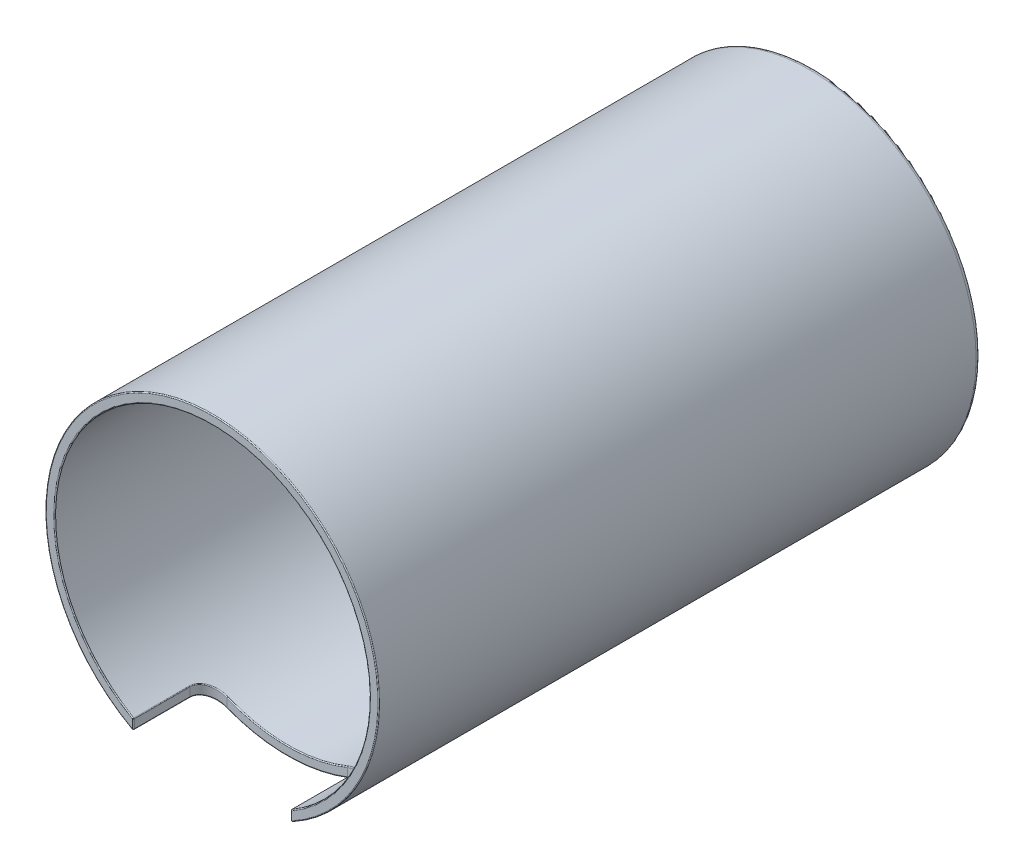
ISO-10303-21;
HEADER;
FILE_DESCRIPTION(('STEP AP214'),'2;1');
FILE_NAME('part.step','',(''),(''),'','','');
FILE_SCHEMA(('AUTOMOTIVE_DESIGN { 1 0 10303 214 1 1 1 1 }'));
ENDSEC;
DATA;
#1=APPLICATION_CONTEXT('core data for automotive mechanical design processes');
#2=APPLICATION_PROTOCOL_DEFINITION('international standard','automotive_design',2000,#1);
#3=PRODUCT_CONTEXT('',#1,'mechanical');
#4=PRODUCT('Part','Part','',(#3));
#5=PRODUCT_RELATED_PRODUCT_CATEGORY('part','',(#4));
#6=PRODUCT_DEFINITION_FORMATION('','',#4);
#7=PRODUCT_DEFINITION_CONTEXT('part definition',#1,'design');
#8=PRODUCT_DEFINITION('design','',#6,#7);
#9=PRODUCT_DEFINITION_SHAPE('','',#8);
#10=(LENGTH_UNIT() NAMED_UNIT(*) SI_UNIT(.MILLI.,.METRE.));
#11=(NAMED_UNIT(*) PLANE_ANGLE_UNIT() SI_UNIT($,.RADIAN.));
#12=(NAMED_UNIT(*) SI_UNIT($,.STERADIAN.) SOLID_ANGLE_UNIT());
#13=UNCERTAINTY_MEASURE_WITH_UNIT(LENGTH_MEASURE(1.E-05),#10,'distance_accuracy_value','');
#14=(GEOMETRIC_REPRESENTATION_CONTEXT(3) GLOBAL_UNCERTAINTY_ASSIGNED_CONTEXT((#13)) GLOBAL_UNIT_ASSIGNED_CONTEXT((#10,
#11,#12)) REPRESENTATION_CONTEXT('',''));
#15=CARTESIAN_POINT('',(0.,0.,0.));
#16=DIRECTION('',(0.,0.,1.));
#17=DIRECTION('',(1.,0.,0.));
#18=AXIS2_PLACEMENT_3D('',#15,#16,#17);
#19=CARTESIAN_POINT('',(0.,0.,65.));
#20=DIRECTION('',(0.,0.,-1.));
#21=DIRECTION('',(-1.,0.,0.));
#22=AXIS2_PLACEMENT_3D('',#19,#20,#21);
#23=CYLINDRICAL_SURFACE('',#22,18.);
#24=CARTESIAN_POINT('',(0.,0.,64.9));
#25=DIRECTION('',(0.,0.,1.));
#26=DIRECTION('',(1.,0.,0.));
#27=AXIS2_PLACEMENT_3D('',#24,#25,#26);
#28=CIRCLE('',#27,18.);
#29=CARTESIAN_POINT('',(-8.64804469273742,-15.7864284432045,64.9));
#30=VERTEX_POINT('',#29);
#31=CARTESIAN_POINT('',(8.64804469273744,-15.7864284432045,64.9));
#32=VERTEX_POINT('',#31);
#33=EDGE_CURVE('E347',#30,#32,#28,.F.);
#34=ORIENTED_EDGE('',*,*,#33,.T.);
#35=DIRECTION('',(0.,0.,-1.));
#36=VECTOR('',#35,1.);
#37=CARTESIAN_POINT('',(8.64804469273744,-15.7864284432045,65.));
#38=LINE('',#37,#36);
#39=CARTESIAN_POINT('',(8.64804469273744,-15.7864284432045,58.9));
#40=VERTEX_POINT('',#39);
#41=EDGE_CURVE('E298',#32,#40,#38,.T.);
#42=ORIENTED_EDGE('',*,*,#41,.T.);
#43=CARTESIAN_POINT('',(8.40597897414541,-15.7524053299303,59.5060067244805));
#44=CARTESIAN_POINT('',(8.40871496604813,-15.8076235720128,59.4974016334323));
#45=CARTESIAN_POINT('',(8.45558857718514,-15.8365116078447,59.5073481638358));
#46=CARTESIAN_POINT('',(8.50246218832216,-15.8653996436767,59.5172946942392));
#47=CARTESIAN_POINT('',(8.54877109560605,-15.8404075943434,59.5363070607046));
#48=CARTESIAN_POINT('',(8.42140851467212,-15.7436608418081,59.4574822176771));
#49=CARTESIAN_POINT('',(8.42373634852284,-15.7991496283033,59.4493950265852));
#50=CARTESIAN_POINT('',(8.47094969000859,-15.8280682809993,59.4585956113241));
#51=CARTESIAN_POINT('',(8.51818318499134,-15.8569757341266,59.4677224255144));
#52=CARTESIAN_POINT('',(8.56506262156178,-15.8316142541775,59.485356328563));
#53=CARTESIAN_POINT('',(8.43502218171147,-15.7359154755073,59.4082378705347));
#54=CARTESIAN_POINT('',(8.43696339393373,-15.7916566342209,59.4007706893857));
#55=CARTESIAN_POINT('',(8.48449092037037,-15.8205957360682,59.4091635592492));
#56=CARTESIAN_POINT('',(8.53203113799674,-15.849527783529,59.4175002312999));
#57=CARTESIAN_POINT('',(8.5794368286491,-15.8238256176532,59.4336497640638));
#58=CARTESIAN_POINT('',(8.45848661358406,-15.7225326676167,59.3085986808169));
#59=CARTESIAN_POINT('',(8.45975218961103,-15.7787125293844,59.3024468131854));
#60=CARTESIAN_POINT('',(8.50781709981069,-15.8076910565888,59.3092137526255));
#61=CARTESIAN_POINT('',(8.55589509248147,-15.8366623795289,59.3159264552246));
#62=CARTESIAN_POINT('',(8.60421212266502,-15.8103680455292,59.3290286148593));
#63=CARTESIAN_POINT('',(8.46833675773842,-15.7168955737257,59.2582036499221));
#64=CARTESIAN_POINT('',(8.46930546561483,-15.7732661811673,59.2527623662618));
#65=CARTESIAN_POINT('',(8.51760142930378,-15.8022592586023,59.2586958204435));
#66=CARTESIAN_POINT('',(8.56590222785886,-15.8312496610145,59.2645904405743));
#67=CARTESIAN_POINT('',(8.61461255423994,-15.8046994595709,59.2761138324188));
#68=CARTESIAN_POINT('',(8.49199403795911,-15.7033405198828,59.1060358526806));
#69=CARTESIAN_POINT('',(8.49226133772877,-15.7601618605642,59.1027465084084));
#70=CARTESIAN_POINT('',(8.54109351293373,-15.7892014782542,59.1062333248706));
#71=CARTESIAN_POINT('',(8.58995150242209,-15.8182267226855,59.1095674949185));
#72=CARTESIAN_POINT('',(8.63959147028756,-15.7910686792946,59.1163376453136));
#73=CARTESIAN_POINT('',(8.49999599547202,-15.6987285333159,59.0030048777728));
#74=CARTESIAN_POINT('',(8.49999630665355,-15.7557179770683,59.0013995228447));
#75=CARTESIAN_POINT('',(8.54902778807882,-15.7847646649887,59.0031034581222));
#76=CARTESIAN_POINT('',(8.59805955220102,-15.8138112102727,59.0048109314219));
#77=CARTESIAN_POINT('',(8.64804046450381,-15.78643092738,59.0081551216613));
#78=CARTESIAN_POINT('',(8.50000400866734,-15.6987235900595,58.7968886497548));
#79=CARTESIAN_POINT('',(8.50000369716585,-15.7557133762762,58.7984956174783));
#80=CARTESIAN_POINT('',(8.549035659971,-15.784759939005,58.7967899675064));
#81=CARTESIAN_POINT('',(8.5980673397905,-15.8138066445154,58.7950806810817));
#82=CARTESIAN_POINT('',(8.64804892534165,-15.7864259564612,58.7917330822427));
#83=CARTESIAN_POINT('',(8.49199352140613,-15.7033401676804,58.693803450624));
#84=CARTESIAN_POINT('',(8.49226012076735,-15.7601618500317,58.6970974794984));
#85=CARTESIAN_POINT('',(8.54109285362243,-15.7892011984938,58.6936063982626));
#86=CARTESIAN_POINT('',(8.58995030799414,-15.8182267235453,58.6902711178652));
#87=CARTESIAN_POINT('',(8.63959092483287,-15.7910683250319,58.6834936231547));
#88=CARTESIAN_POINT('',(8.46038700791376,-15.7214512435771,58.4908201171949));
#89=CARTESIAN_POINT('',(8.46160380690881,-15.7776633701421,58.4970558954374));
#90=CARTESIAN_POINT('',(8.50970734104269,-15.8066477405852,58.4902284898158));
#91=CARTESIAN_POINT('',(8.5578336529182,-15.835619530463,58.4835530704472));
#92=CARTESIAN_POINT('',(8.60621868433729,-15.8092805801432,58.4703611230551));
#93=CARTESIAN_POINT('',(8.43679501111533,-15.7349434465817,58.3909211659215));
#94=CARTESIAN_POINT('',(8.43874027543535,-15.7906884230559,58.3985536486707));
#95=CARTESIAN_POINT('',(8.48626864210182,-15.8196508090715,58.3900333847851));
#96=CARTESIAN_POINT('',(8.53388556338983,-15.8485644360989,58.3817904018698));
#97=CARTESIAN_POINT('',(8.58130869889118,-15.8228481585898,58.3654672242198));
#98=CARTESIAN_POINT('',(8.37525394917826,-15.7698156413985,58.1973516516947));
#99=CARTESIAN_POINT('',(8.37886298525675,-15.8244609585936,58.207197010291));
#100=CARTESIAN_POINT('',(8.42499912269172,-15.8533226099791,58.1955578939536));
#101=CARTESIAN_POINT('',(8.47122021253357,-15.8821376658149,58.1841922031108));
#102=CARTESIAN_POINT('',(8.51632958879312,-15.8579151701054,58.1622192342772));
#103=CARTESIAN_POINT('',(8.33734749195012,-15.7911722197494,58.1036635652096));
#104=CARTESIAN_POINT('',(8.34196695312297,-15.8451435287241,58.1144261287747));
#105=CARTESIAN_POINT('',(8.38721101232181,-15.8739685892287,58.1012609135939));
#106=CARTESIAN_POINT('',(8.43262592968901,-15.902701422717,58.0884423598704));
#107=CARTESIAN_POINT('',(8.47630545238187,-15.8793910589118,58.0638467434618));
#108=CARTESIAN_POINT('',(8.24870683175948,-15.8405018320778,57.9242714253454));
#109=CARTESIAN_POINT('',(8.25534487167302,-15.8930635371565,57.9362956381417));
#110=CARTESIAN_POINT('',(8.29864066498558,-15.921757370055,57.9203257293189));
#111=CARTESIAN_POINT('',(8.34210516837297,-15.9503602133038,57.9047028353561));
#112=CARTESIAN_POINT('',(8.38271280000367,-15.9289962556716,57.8754849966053));
#113=CARTESIAN_POINT('',(8.19796562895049,-15.8684784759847,57.8385717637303));
#114=CARTESIAN_POINT('',(8.20569756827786,-15.9202591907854,57.8509872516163));
#115=CARTESIAN_POINT('',(8.2478513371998,-15.9489037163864,57.8336917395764));
#116=CARTESIAN_POINT('',(8.29026073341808,-15.9774136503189,57.816765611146));
#117=CARTESIAN_POINT('',(8.32913689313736,-15.9571291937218,57.7855003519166));
#118=CARTESIAN_POINT('',(8.08221947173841,-15.9313404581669,57.6722327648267));
#119=CARTESIAN_POINT('',(8.09204421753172,-15.9815255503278,57.6849816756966));
#120=CARTESIAN_POINT('',(8.13173039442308,-16.0100259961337,57.6651665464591));
#121=CARTESIAN_POINT('',(8.17169805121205,-16.0383783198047,57.6457616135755));
#122=CARTESIAN_POINT('',(8.20692447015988,-16.020342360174,57.6108444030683));
#123=CARTESIAN_POINT('',(8.01657798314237,-15.9665235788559,57.5921402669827));
#124=CARTESIAN_POINT('',(8.0274690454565,-16.015858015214,57.6047848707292));
#125=CARTESIAN_POINT('',(8.06574689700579,-16.0442978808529,57.5838074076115));
#126=CARTESIAN_POINT('',(8.10439156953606,-16.072550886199,57.5632165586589));
#127=CARTESIAN_POINT('',(8.13761585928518,-16.0557220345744,57.5267472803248));
#128=CARTESIAN_POINT('',(7.87473035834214,-16.0411435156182,57.4437439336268));
#129=CARTESIAN_POINT('',(7.88745884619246,-16.0888467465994,57.4558122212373));
#130=CARTESIAN_POINT('',(7.92285087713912,-16.1171282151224,57.4327118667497));
#131=CARTESIAN_POINT('',(7.95861002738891,-16.1452224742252,57.4100009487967));
#132=CARTESIAN_POINT('',(7.98784378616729,-16.1307588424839,57.3709311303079));
#133=CARTESIAN_POINT('',(7.79850254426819,-16.0805890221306,57.3754649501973));
#134=CARTESIAN_POINT('',(7.81207356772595,-16.1274811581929,57.3870192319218));
#135=CARTESIAN_POINT('',(7.84591592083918,-16.1556954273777,57.3629999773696));
#136=CARTESIAN_POINT('',(7.88018634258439,-16.1836996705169,57.3393123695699));
#137=CARTESIAN_POINT('',(7.9073574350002,-16.1704247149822,57.299238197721));
#138=CARTESIAN_POINT('',(7.62824405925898,-16.1668480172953,57.2447499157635));
#139=CARTESIAN_POINT('',(7.64328706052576,-16.2120981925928,57.2550421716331));
#140=CARTESIAN_POINT('',(7.67376178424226,-16.2401765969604,57.229223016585));
#141=CARTESIAN_POINT('',(7.70476233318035,-16.2679969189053,57.2038135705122));
#142=CARTESIAN_POINT('',(7.72758730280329,-16.2571656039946,57.1619874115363));
#143=CARTESIAN_POINT('',(7.53317464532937,-16.2139892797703,57.1838612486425));
#144=CARTESIAN_POINT('',(7.54881773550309,-16.2584254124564,57.1932557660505));
#145=CARTESIAN_POINT('',(7.57745826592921,-16.28642727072,57.1667015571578));
#146=CARTESIAN_POINT('',(7.6066686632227,-16.3141628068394,57.1404518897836));
#147=CARTESIAN_POINT('',(7.62720674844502,-16.3045702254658,57.0980543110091));
#148=CARTESIAN_POINT('',(7.3349070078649,-16.3097550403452,57.0791526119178));
#149=CARTESIAN_POINT('',(7.35133956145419,-16.3526789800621,57.0867054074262));
#150=CARTESIAN_POINT('',(7.37628709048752,-16.380529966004,57.0588550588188));
#151=CARTESIAN_POINT('',(7.40180136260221,-16.4081155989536,57.0313094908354));
#152=CARTESIAN_POINT('',(7.41786270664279,-16.4008709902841,56.988110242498));
#153=CARTESIAN_POINT('',(7.23172009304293,-16.3583774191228,57.0353093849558));
#154=CARTESIAN_POINT('',(7.24836765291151,-16.4006049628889,57.0418105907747));
#155=CARTESIAN_POINT('',(7.2714313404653,-16.4283797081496,57.0135065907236));
#156=CARTESIAN_POINT('',(7.29506480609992,-16.4559019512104,56.9853937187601));
#157=CARTESIAN_POINT('',(7.30891115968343,-16.4497650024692,56.9420748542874));
#158=CARTESIAN_POINT('',(7.02514386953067,-16.4529930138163,56.9672798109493));
#159=CARTESIAN_POINT('',(7.04184873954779,-16.4939718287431,56.9718217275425));
#160=CARTESIAN_POINT('',(7.06124903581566,-16.5216094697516,56.9427967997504));
#161=CARTESIAN_POINT('',(7.08115855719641,-16.5490210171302,56.9139437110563));
#162=CARTESIAN_POINT('',(7.09079436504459,-16.5449091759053,56.8706438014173));
#163=CARTESIAN_POINT('',(6.922058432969,-16.4989882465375,56.9421703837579));
#164=CARTESIAN_POINT('',(6.93864240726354,-16.5394136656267,56.9457143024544));
#165=CARTESIAN_POINT('',(6.95624539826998,-16.5669852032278,56.9164990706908));
#166=CARTESIAN_POINT('',(6.9743325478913,-16.5943532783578,56.8873654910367));
#167=CARTESIAN_POINT('',(6.98194996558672,-16.5911613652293,56.8442789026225));
#168=CARTESIAN_POINT('',(6.71279751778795,-16.5897421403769,56.9085312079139));
#169=CARTESIAN_POINT('',(6.72890664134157,-16.6291324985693,56.9102467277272));
#170=CARTESIAN_POINT('',(6.74289648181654,-16.6566055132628,56.8807988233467));
#171=CARTESIAN_POINT('',(6.75736939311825,-16.6838756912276,56.8514311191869));
#172=CARTESIAN_POINT('',(6.76099849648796,-16.6824222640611,56.8089577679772));
#173=CARTESIAN_POINT('',(6.60662377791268,-16.6345014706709,56.8999923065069));
#174=CARTESIAN_POINT('',(6.622345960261,-16.6734359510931,56.9007936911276));
#175=CARTESIAN_POINT('',(6.63455308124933,-16.700850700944,56.8713869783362));
#176=CARTESIAN_POINT('',(6.64719928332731,-16.7280921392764,56.8419795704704));
#177=CARTESIAN_POINT('',(6.64889326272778,-16.7274316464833,56.7999919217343));
#178=CARTESIAN_POINT('',(6.38539672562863,-16.7250223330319,56.9000082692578));
#179=CARTESIAN_POINT('',(6.40018475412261,-16.7630570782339,56.8991504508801));
#180=CARTESIAN_POINT('',(6.40865299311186,-16.7904060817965,56.8699837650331));
#181=CARTESIAN_POINT('',(6.41762250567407,-16.8175555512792,56.8408238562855));
#182=CARTESIAN_POINT('',(6.41530715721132,-16.818458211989,56.8000086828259));
#183=CARTESIAN_POINT('',(6.27027353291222,-16.7706081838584,56.9098902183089));
#184=CARTESIAN_POINT('',(6.28440647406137,-16.8082546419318,56.9082216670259));
#185=CARTESIAN_POINT('',(6.29101360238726,-16.8355481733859,56.8793488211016));
#186=CARTESIAN_POINT('',(6.29803980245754,-16.8626839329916,56.8504153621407));
#187=CARTESIAN_POINT('',(6.29375250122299,-16.8642987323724,56.810384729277));
#188=CARTESIAN_POINT('',(6.04192770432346,-16.8581793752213,56.949686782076));
#189=CARTESIAN_POINT('',(6.05468991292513,-16.8950948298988,56.9466638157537));
#190=CARTESIAN_POINT('',(6.05755973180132,-16.9223319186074,56.9185874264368));
#191=CARTESIAN_POINT('',(6.06086653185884,-16.9494085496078,56.890427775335));
#192=CARTESIAN_POINT('',(6.05264992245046,-16.9523591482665,56.852171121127));
#193=CARTESIAN_POINT('',(5.92871107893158,-16.9001546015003,56.9796557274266));
#194=CARTESIAN_POINT('',(5.94067506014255,-16.9367691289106,56.9760278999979));
#195=CARTESIAN_POINT('',(5.94175107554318,-16.9639637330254,56.9485166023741));
#196=CARTESIAN_POINT('',(5.94319681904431,-16.9910363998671,56.9208418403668));
#197=CARTESIAN_POINT('',(5.93310834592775,-16.9945688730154,56.8836385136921));
#198=CARTESIAN_POINT('',(5.8182438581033,-16.9397030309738,57.0197849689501));
#199=CARTESIAN_POINT('',(5.82922714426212,-16.9760981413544,57.0158024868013));
#200=CARTESIAN_POINT('',(5.82871881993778,-17.0032137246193,56.9888658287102));
#201=CARTESIAN_POINT('',(5.82821049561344,-17.0303293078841,56.961929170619));
#202=CARTESIAN_POINT('',(5.81646977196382,-17.0343382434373,56.9257742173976));
#203=(BOUNDED_SURFACE() B_SPLINE_SURFACE(3,2,((#43,#44,#45,#46,#47),(#48,#49,#50,#51,#52),(#53,
#54,#55,#56,#57),(#58,#59,#60,#61,#62),(#63,#64,#65,#66,#67),(#68,#69,#70,#71,#72),(#73,#74,#75,
#76,#77),(#78,#79,#80,#81,#82),(#83,#84,#85,#86,#87),(#88,#89,#90,#91,#92),(#93,#94,#95,#96,
#97),(#98,#99,#100,#101,#102),(#103,#104,#105,#106,#107),(#108,#109,#110,#111,#112),(#113,#114,
#115,#116,#117),(#118,#119,#120,#121,#122),(#123,#124,#125,#126,#127),(#128,#129,#130,#131,
#132),(#133,#134,#135,#136,#137),(#138,#139,#140,#141,#142),(#143,#144,#145,#146,#147),(#148,
#149,#150,#151,#152),(#153,#154,#155,#156,#157),(#158,#159,#160,#161,#162),(#163,#164,#165,#166,
#167),(#168,#169,#170,#171,#172),(#173,#174,#175,#176,#177),(#178,#179,#180,#181,#182),(#183,
#184,#185,#186,#187),(#188,#189,#190,#191,#192),(#193,#194,#195,#196,#197),(#198,#199,#200,#201,
#202)),.UNSPECIFIED.,.F.,.F.,.F.) B_SPLINE_SURFACE_WITH_KNOTS((4,2,2,2,2,2,2,2,2,2,2,2,2,2,2,4),
(3,2,3),(0.,0.162431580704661,0.324889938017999,0.64889563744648,0.973236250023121,
1.29749301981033,1.62079213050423,1.9442679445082,2.28574135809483,2.62792461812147,
3.00901976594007,3.38959309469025,3.74988384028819,4.10997552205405,4.49701569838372,
4.88510697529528),(0.,0.5,1.),
.UNSPECIFIED.) GEOMETRIC_REPRESENTATION_ITEM() RATIONAL_B_SPLINE_SURFACE(((1.,0.872685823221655,
1.,0.872685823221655,1.),(1.,0.872065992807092,1.,0.872065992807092,1.),(1.,0.871512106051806,
1.,0.871512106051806,1.),(1.,0.870549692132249,1.,0.870549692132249,1.),(1.,0.870141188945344,
1.,0.870141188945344,1.),(1.,0.869156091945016,1.,0.869156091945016,1.),(1.,0.868816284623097,
1.,0.868816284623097,1.),(1.,0.868815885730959,1.,0.868815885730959,1.),(1.,0.869155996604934,
1.,0.869155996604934,1.),(1.,0.870472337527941,1.,0.870472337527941,1.),(1.,0.871448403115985,
1.,0.871448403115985,1.),(1.,0.873919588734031,1.,0.873919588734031,1.),(1.,0.875413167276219,
1.,0.875413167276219,1.),(1.,0.878775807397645,1.,0.878775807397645,1.),(1.,0.880645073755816,
1.,0.880645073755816,1.),(1.,0.884725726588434,1.,0.884725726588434,1.),(1.,0.886950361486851,
1.,0.886950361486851,1.),(1.,0.891517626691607,1.,0.891517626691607,1.),(1.,0.893860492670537,
1.,0.893860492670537,1.),(1.,0.898814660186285,1.,0.898814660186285,1.),(1.,0.901426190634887,
1.,0.901426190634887,1.),(1.,0.906533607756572,1.,0.906533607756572,1.),(1.,0.909029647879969,
1.,0.909029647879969,1.),(1.,0.913704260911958,1.,0.913704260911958,1.),(1.,0.915892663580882,
1.,0.915892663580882,1.),(1.,0.920054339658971,1.,0.920054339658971,1.),(1.,0.922027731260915,
1.,0.922027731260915,1.),(1.,0.925869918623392,1.,0.925869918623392,1.),(1.,0.927719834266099,
1.,0.927719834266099,1.),(1.,0.931127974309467,1.,0.931127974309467,1.),(1.,0.932685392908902,
1.,0.932685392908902,1.),(1.,0.934086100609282,1.,0.934086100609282,1.))) REPRESENTATION_ITEM('') SURFACE());
#204=CARTESIAN_POINT('',(8.54877109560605,-15.8404075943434,59.5363070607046));
#205=CARTESIAN_POINT('',(8.56506262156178,-15.8316142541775,59.485356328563));
#206=CARTESIAN_POINT('',(8.5794368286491,-15.8238256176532,59.4336497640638));
#207=CARTESIAN_POINT('',(8.60421212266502,-15.8103680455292,59.3290286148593));
#208=CARTESIAN_POINT('',(8.61461255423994,-15.8046994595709,59.2761138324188));
#209=CARTESIAN_POINT('',(8.63959147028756,-15.7910686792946,59.1163376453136));
#210=CARTESIAN_POINT('',(8.64804046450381,-15.78643092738,59.0081551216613));
#211=CARTESIAN_POINT('',(8.64804892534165,-15.7864259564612,58.7917330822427));
#212=CARTESIAN_POINT('',(8.63959092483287,-15.7910683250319,58.6834936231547));
#213=CARTESIAN_POINT('',(8.60621868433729,-15.8092805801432,58.4703611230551));
#214=CARTESIAN_POINT('',(8.58130869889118,-15.8228481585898,58.3654672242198));
#215=CARTESIAN_POINT('',(8.51632958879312,-15.8579151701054,58.1622192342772));
#216=CARTESIAN_POINT('',(8.47630545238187,-15.8793910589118,58.0638467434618));
#217=CARTESIAN_POINT('',(8.38271280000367,-15.9289962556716,57.8754849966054));
#218=CARTESIAN_POINT('',(8.32913689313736,-15.9571291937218,57.7855003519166));
#219=CARTESIAN_POINT('',(8.20692447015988,-16.020342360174,57.6108444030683));
#220=CARTESIAN_POINT('',(8.13761585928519,-16.0557220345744,57.5267472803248));
#221=CARTESIAN_POINT('',(7.98784378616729,-16.1307588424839,57.3709311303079));
#222=CARTESIAN_POINT('',(7.9073574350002,-16.1704247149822,57.299238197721));
#223=CARTESIAN_POINT('',(7.72758730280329,-16.2571656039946,57.1619874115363));
#224=CARTESIAN_POINT('',(7.62720674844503,-16.3045702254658,57.0980543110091));
#225=CARTESIAN_POINT('',(7.41786270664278,-16.4008709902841,56.988110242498));
#226=CARTESIAN_POINT('',(7.30891115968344,-16.4497650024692,56.9420748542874));
#227=CARTESIAN_POINT('',(7.09079436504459,-16.5449091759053,56.8706438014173));
#228=CARTESIAN_POINT('',(6.98194996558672,-16.5911613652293,56.8442789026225));
#229=CARTESIAN_POINT('',(6.76099849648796,-16.6824222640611,56.8089577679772));
#230=CARTESIAN_POINT('',(6.64889326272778,-16.7274316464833,56.7999919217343));
#231=CARTESIAN_POINT('',(6.41530715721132,-16.818458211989,56.8000086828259));
#232=CARTESIAN_POINT('',(6.29375250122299,-16.8642987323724,56.810384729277));
#233=CARTESIAN_POINT('',(6.05264992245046,-16.9523591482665,56.852171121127));
#234=CARTESIAN_POINT('',(5.93310834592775,-16.9945688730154,56.8836385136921));
#235=CARTESIAN_POINT('',(5.81646977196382,-17.0343382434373,56.9257742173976));
#236=B_SPLINE_CURVE_WITH_KNOTS('',3,(#204,#205,#206,#207,#208,#209,#210,#211,#212,#213,#214,
#215,#216,#217,#218,#219,#220,#221,#222,#223,#224,#225,#226,#227,#228,#229,#230,#231,#232,#233,
#234,#235),.UNSPECIFIED.,.F.,.F.,(4,2,2,2,2,2,2,2,2,2,2,2,2,2,2,4),(0.,0.162431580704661,
0.324889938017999,0.64889563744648,0.973236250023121,1.29749301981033,1.62079213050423,
1.9442679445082,2.28574135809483,2.62792461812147,3.00901976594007,3.38959309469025,
3.74988384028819,4.10997552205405,4.49701569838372,4.88510697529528),.UNSPECIFIED.);
#237=CARTESIAN_POINT('',(6.53631284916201,-16.7713032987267,56.8));
#238=VERTEX_POINT('',#237);
#239=EDGE_CURVE('E293',#40,#238,#236,.T.);
#240=ORIENTED_EDGE('',*,*,#239,.T.);
#241=CARTESIAN_POINT('',(0.,0.,56.8));
#242=DIRECTION('',(0.,0.,-1.));
#243=DIRECTION('',(-1.,0.,0.));
#244=AXIS2_PLACEMENT_3D('',#241,#242,#243);
#245=CIRCLE('',#244,18.);
#246=CARTESIAN_POINT('',(-6.53631284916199,-16.7713032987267,56.8));
#247=VERTEX_POINT('',#246);
#248=EDGE_CURVE('E289',#238,#247,#245,.T.);
#249=ORIENTED_EDGE('',*,*,#248,.T.);
#250=CARTESIAN_POINT('',(-5.81824385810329,-16.9397030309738,57.0197849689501));
#251=CARTESIAN_POINT('',(-5.8292271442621,-16.9760981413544,57.0158024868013));
#252=CARTESIAN_POINT('',(-5.82871881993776,-17.0032137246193,56.9888658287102));
#253=CARTESIAN_POINT('',(-5.82821049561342,-17.0303293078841,56.961929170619));
#254=CARTESIAN_POINT('',(-5.8164697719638,-17.0343382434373,56.9257742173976));
#255=CARTESIAN_POINT('',(-5.92867801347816,-16.9001646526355,56.9796755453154));
#256=CARTESIAN_POINT('',(-5.94064057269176,-16.9367795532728,56.9760479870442));
#257=CARTESIAN_POINT('',(-5.94171717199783,-16.9639737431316,56.9485367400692));
#258=CARTESIAN_POINT('',(-5.94316130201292,-16.9910468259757,56.9208625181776));
#259=CARTESIAN_POINT('',(-5.93307343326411,-16.9945789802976,56.883659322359));
#260=CARTESIAN_POINT('',(-6.0418348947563,-16.8582129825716,56.949714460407));
#261=CARTESIAN_POINT('',(-6.05459579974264,-16.8951284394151,56.9466912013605));
#262=CARTESIAN_POINT('',(-6.05746476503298,-16.922365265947,56.9186151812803));
#263=CARTESIAN_POINT('',(-6.06076943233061,-16.9494421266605,56.8904561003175));
#264=CARTESIAN_POINT('',(-6.05255192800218,-16.952392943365,56.8522001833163));
#265=CARTESIAN_POINT('',(-6.27016254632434,-16.7706526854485,56.9098981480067));
#266=CARTESIAN_POINT('',(-6.2842954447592,-16.8082985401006,56.9082286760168));
#267=CARTESIAN_POINT('',(-6.29090021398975,-16.8355922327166,56.8793561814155));
#268=CARTESIAN_POINT('',(-6.29792510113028,-16.8627277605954,56.8504228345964));
#269=CARTESIAN_POINT('',(-6.29363531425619,-16.8643434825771,56.8103930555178));
#270=CARTESIAN_POINT('',(-6.38532927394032,-16.7250508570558,56.9000064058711));
#271=CARTESIAN_POINT('',(-6.40011790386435,-16.7630849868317,56.8991478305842));
#272=CARTESIAN_POINT('',(-6.40858415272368,-16.7904342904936,56.8699813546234));
#273=CARTESIAN_POINT('',(-6.41755338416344,-16.817583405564,56.8408213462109));
#274=CARTESIAN_POINT('',(-6.41523593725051,-16.8184868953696,56.8000067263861));
#275=CARTESIAN_POINT('',(-6.62188016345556,-16.6282579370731,56.8999931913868));
#276=CARTESIAN_POINT('',(-6.63773441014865,-16.6672271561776,56.900909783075));
#277=CARTESIAN_POINT('',(-6.65013169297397,-16.6946737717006,56.8714858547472));
#278=CARTESIAN_POINT('',(-6.66310143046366,-16.7218942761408,56.8420619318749));
#279=CARTESIAN_POINT('',(-6.6650019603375,-16.7211532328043,56.7999928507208));
#280=CARTESIAN_POINT('',(-6.74319999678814,-16.5768956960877,56.9111537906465));
#281=CARTESIAN_POINT('',(-6.75948767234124,-16.6163880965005,56.9131419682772));
#282=CARTESIAN_POINT('',(-6.77391864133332,-16.6439073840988,56.8836756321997));
#283=CARTESIAN_POINT('',(-6.78898747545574,-16.6711565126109,56.8543307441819));
#284=CARTESIAN_POINT('',(-6.79309943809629,-16.6695040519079,56.8117114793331));
#285=CARTESIAN_POINT('',(-6.98137431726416,-16.4727684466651,56.9550195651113));
#286=CARTESIAN_POINT('',(-6.99812025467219,-16.5134750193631,56.9591212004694));
#287=CARTESIAN_POINT('',(-7.01668246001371,-16.5411106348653,56.9299986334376));
#288=CARTESIAN_POINT('',(-7.03588456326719,-16.5684753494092,56.900998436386));
#289=CARTESIAN_POINT('',(-7.04457958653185,-16.5647950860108,56.8577705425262));
#290=CARTESIAN_POINT('',(-7.09822612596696,-16.4200026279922,56.9877374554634));
#291=CARTESIAN_POINT('',(-7.11504155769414,-16.4613632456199,56.9930085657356));
#292=CARTESIAN_POINT('',(-7.13565644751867,-16.4890795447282,56.9641448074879));
#293=CARTESIAN_POINT('',(-7.15694003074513,-16.5164944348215,56.9355414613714));
#294=CARTESIAN_POINT('',(-7.16795942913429,-16.5117344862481,56.892124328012));
#295=CARTESIAN_POINT('',(-7.32426385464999,-16.3149196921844,57.0737438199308));
#296=CARTESIAN_POINT('',(-7.34078392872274,-16.3577469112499,57.0811633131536));
#297=CARTESIAN_POINT('',(-7.36548249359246,-16.3856081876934,57.0532706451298));
#298=CARTESIAN_POINT('',(-7.39085214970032,-16.4131676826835,57.0256371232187));
#299=CARTESIAN_POINT('',(-7.40662496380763,-16.406064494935,56.9824310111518));
#300=CARTESIAN_POINT('',(-7.43345157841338,-16.2626024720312,57.1270274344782));
#301=CARTESIAN_POINT('',(-7.44960985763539,-16.3062226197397,57.1355650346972));
#302=CARTESIAN_POINT('',(-7.47633646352,-16.3341677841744,57.1082453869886));
#303=CARTESIAN_POINT('',(-7.5037149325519,-16.361802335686,57.0813280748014));
#304=CARTESIAN_POINT('',(-7.52191256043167,-16.3534549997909,57.0383788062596));
#305=CARTESIAN_POINT('',(-7.64119343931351,-16.1604890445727,57.2530532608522));
#306=CARTESIAN_POINT('',(-7.6562227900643,-16.2058223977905,57.2634430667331));
#307=CARTESIAN_POINT('',(-7.68688016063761,-16.2339382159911,57.2377369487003));
#308=CARTESIAN_POINT('',(-7.71819200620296,-16.2617427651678,57.2124319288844));
#309=CARTESIAN_POINT('',(-7.74126011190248,-16.2507711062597,57.1707059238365));
#310=CARTESIAN_POINT('',(-7.73974762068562,-16.1106928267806,57.3257953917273));
#311=CARTESIAN_POINT('',(-7.75396171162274,-16.1569528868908,57.3370512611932));
#312=CARTESIAN_POINT('',(-7.78656993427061,-16.1851490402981,57.3122536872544));
#313=CARTESIAN_POINT('',(-7.81975769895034,-16.2130551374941,57.2879810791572));
#314=CARTESIAN_POINT('',(-7.84532011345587,-16.2006966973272,57.2470851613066));
#315=CARTESIAN_POINT('',(-7.92218078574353,-16.0165104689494,57.4885491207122));
#316=CARTESIAN_POINT('',(-7.93447380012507,-16.064675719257,57.5009354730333));
#317=CARTESIAN_POINT('',(-7.97071641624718,-16.093056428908,57.4784032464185));
#318=CARTESIAN_POINT('',(-8.00753045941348,-16.1211515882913,57.4563845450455));
#319=CARTESIAN_POINT('',(-8.03794507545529,-16.1059881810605,57.4179765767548));
#320=CARTESIAN_POINT('',(-8.00619779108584,-15.9720748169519,57.5783790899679));
#321=CARTESIAN_POINT('',(-8.01729249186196,-16.0212532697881,57.5911356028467));
#322=CARTESIAN_POINT('',(-8.05531665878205,-16.0497026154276,57.5698558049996));
#323=CARTESIAN_POINT('',(-8.09378407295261,-16.0779208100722,57.5491601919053));
#324=CARTESIAN_POINT('',(-8.12665576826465,-16.0613042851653,57.5122980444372));
#325=CARTESIAN_POINT('',(-8.15748512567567,-15.8907037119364,57.7739464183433));
#326=CARTESIAN_POINT('',(-8.16611380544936,-15.9418457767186,57.7866922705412));
#327=CARTESIAN_POINT('',(-8.20730219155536,-15.9704842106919,57.768309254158));
#328=CARTESIAN_POINT('',(-8.24893821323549,-15.9988894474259,57.7505052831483));
#329=CARTESIAN_POINT('',(-8.28639490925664,-15.9794785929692,57.7176437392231));
#330=CARTESIAN_POINT('',(-8.22475996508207,-15.853766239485,57.8796794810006));
#331=CARTESIAN_POINT('',(-8.23197242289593,-15.9059289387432,57.892069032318));
#332=CARTESIAN_POINT('',(-8.27469211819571,-15.9346176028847,57.8753059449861));
#333=CARTESIAN_POINT('',(-8.31768961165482,-15.9631569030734,57.8590966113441));
#334=CARTESIAN_POINT('',(-8.35742811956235,-15.9423347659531,57.8286634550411));
#335=CARTESIAN_POINT('',(-8.33402854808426,-15.7930656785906,58.0940815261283));
#336=CARTESIAN_POINT('',(-8.33877382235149,-15.8469581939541,58.1050062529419));
#337=CARTESIAN_POINT('',(-8.38391013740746,-15.8757953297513,58.0916291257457));
#338=CARTESIAN_POINT('',(-8.42928245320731,-15.9045051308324,58.0787162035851));
#339=CARTESIAN_POINT('',(-8.47280109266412,-15.8812950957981,58.0537856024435));
#340=CARTESIAN_POINT('',(-8.37774455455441,-15.7684201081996,58.2016432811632));
#341=CARTESIAN_POINT('',(-8.38130220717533,-15.8231016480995,58.2115037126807));
#342=CARTESIAN_POINT('',(-8.42748466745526,-15.8519721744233,58.1998924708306));
#343=CARTESIAN_POINT('',(-8.47377055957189,-15.8807859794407,58.1886330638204));
#344=CARTESIAN_POINT('',(-8.51895933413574,-15.8565118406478,58.1667254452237));
#345=CARTESIAN_POINT('',(-8.4460148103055,-15.7296999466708,58.4241060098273));
#346=CARTESIAN_POINT('',(-8.44771279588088,-15.7856076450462,58.431365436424));
#347=CARTESIAN_POINT('',(-8.49544047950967,-15.8145914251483,58.4233465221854));
#348=CARTESIAN_POINT('',(-8.54327887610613,-15.8435141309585,58.4156799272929));
#349=CARTESIAN_POINT('',(-8.59104357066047,-15.8175753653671,58.4003113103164));
#350=CARTESIAN_POINT('',(-8.47062526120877,-15.7155943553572,58.5389843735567));
#351=CARTESIAN_POINT('',(-8.47153873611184,-15.7720018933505,58.5445567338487));
#352=CARTESIAN_POINT('',(-8.51987805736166,-15.8010037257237,58.5385158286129));
#353=CARTESIAN_POINT('',(-8.56824020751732,-15.8299929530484,58.5326313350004));
#354=CARTESIAN_POINT('',(-8.61702890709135,-15.8033909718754,58.520933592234));
#355=CARTESIAN_POINT('',(-8.494980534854,-15.7016154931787,58.7364159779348));
#356=CARTESIAN_POINT('',(-8.49514214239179,-15.7585028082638,58.7390098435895));
#357=CARTESIAN_POINT('',(-8.5440533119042,-15.7875426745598,58.7362608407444));
#358=CARTESIAN_POINT('',(-8.59297185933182,-15.8165783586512,58.7335933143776));
#359=CARTESIAN_POINT('',(-8.64274481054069,-15.7893340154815,58.728236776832));
#360=CARTESIAN_POINT('',(-8.50001019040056,-15.6987191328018,58.8181791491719));
#361=CARTESIAN_POINT('',(-8.5000083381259,-15.7557097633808,58.8194555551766));
#362=CARTESIAN_POINT('',(-8.54904141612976,-15.7847558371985,58.8181012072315));
#363=CARTESIAN_POINT('',(-8.59807235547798,-15.8138030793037,58.8167457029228));
#364=CARTESIAN_POINT('',(-8.64805545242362,-15.7864214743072,58.8140881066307));
#365=CARTESIAN_POINT('',(-8.49998720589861,-15.6987347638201,59.002726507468));
#366=CARTESIAN_POINT('',(-8.49998953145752,-15.7557231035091,59.0011237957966));
#367=CARTESIAN_POINT('',(-8.54901955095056,-15.7847704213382,59.0028243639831));
#368=CARTESIAN_POINT('',(-8.59805225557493,-15.8138162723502,59.0045260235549));
#369=CARTESIAN_POINT('',(-8.64803118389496,-15.7864371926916,59.0078628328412));
#370=CARTESIAN_POINT('',(-8.49203013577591,-15.7033199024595,59.1055439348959));
#371=CARTESIAN_POINT('',(-8.49229649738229,-15.7601418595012,59.102262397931));
#372=CARTESIAN_POINT('',(-8.54112938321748,-15.7891816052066,59.1057408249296));
#373=CARTESIAN_POINT('',(-8.58998832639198,-15.8182068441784,59.1090671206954));
#374=CARTESIAN_POINT('',(-8.6396295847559,-15.7910479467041,59.1158211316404));
#375=CARTESIAN_POINT('',(-8.4684475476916,-15.7168320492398,59.2576211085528));
#376=CARTESIAN_POINT('',(-8.46941278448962,-15.773204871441,59.2521881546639));
#377=CARTESIAN_POINT('',(-8.51771142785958,-15.8021980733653,59.2581119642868));
#378=CARTESIAN_POINT('',(-8.5660146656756,-15.8311887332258,59.2639971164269));
#379=CARTESIAN_POINT('',(-8.61472953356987,-15.8046355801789,59.2755021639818));
#380=CARTESIAN_POINT('',(-8.45858593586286,-15.7224758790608,59.3081420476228));
#381=CARTESIAN_POINT('',(-8.45984854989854,-15.7786576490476,59.30199635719));
#382=CARTESIAN_POINT('',(-8.5079157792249,-15.8076363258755,59.3087558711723));
#383=CARTESIAN_POINT('',(-8.55599602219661,-15.836607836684,59.3154610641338));
#384=CARTESIAN_POINT('',(-8.60431699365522,-15.8103109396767,59.3285491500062));
#385=CARTESIAN_POINT('',(-8.43508244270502,-15.7358812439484,59.4080165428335));
#386=CARTESIAN_POINT('',(-8.43702206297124,-15.791623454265,59.400551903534));
#387=CARTESIAN_POINT('',(-8.48455088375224,-15.8205626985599,59.4089413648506));
#388=CARTESIAN_POINT('',(-8.53209255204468,-15.8494948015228,59.4172742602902));
#389=CARTESIAN_POINT('',(-8.57950045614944,-15.8237911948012,59.4334173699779));
#390=CARTESIAN_POINT('',(-8.42144206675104,-15.7436419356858,59.4573705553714));
#391=CARTESIAN_POINT('',(-8.42376920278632,-15.7991312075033,59.4492842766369));
#392=CARTESIAN_POINT('',(-8.47098313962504,-15.8280500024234,59.4584833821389));
#393=CARTESIAN_POINT('',(-8.51821755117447,-15.8569574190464,59.4676080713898));
#394=CARTESIAN_POINT('',(-8.56509804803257,-15.8315952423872,59.4852390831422));
#395=CARTESIAN_POINT('',(-8.40597897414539,-15.7524053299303,59.5060067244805));
#396=CARTESIAN_POINT('',(-8.40871496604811,-15.8076235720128,59.4974016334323));
#397=CARTESIAN_POINT('',(-8.45558857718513,-15.8365116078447,59.5073481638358));
#398=CARTESIAN_POINT('',(-8.50246218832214,-15.8653996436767,59.5172946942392));
#399=CARTESIAN_POINT('',(-8.54877109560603,-15.8404075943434,59.5363070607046));
#400=(BOUNDED_SURFACE() B_SPLINE_SURFACE(3,2,((#250,#251,#252,#253,#254),(#255,#256,#257,#258,
#259),(#260,#261,#262,#263,#264),(#265,#266,#267,#268,#269),(#270,#271,#272,#273,#274),(#275,
#276,#277,#278,#279),(#280,#281,#282,#283,#284),(#285,#286,#287,#288,#289),(#290,#291,#292,#293,
#294),(#295,#296,#297,#298,#299),(#300,#301,#302,#303,#304),(#305,#306,#307,#308,#309),(#310,
#311,#312,#313,#314),(#315,#316,#317,#318,#319),(#320,#321,#322,#323,#324),(#325,#326,#327,#328,
#329),(#330,#331,#332,#333,#334),(#335,#336,#337,#338,#339),(#340,#341,#342,#343,#344),(#345,
#346,#347,#348,#349),(#350,#351,#352,#353,#354),(#355,#356,#357,#358,#359),(#360,#361,#362,#363,
#364),(#365,#366,#367,#368,#369),(#370,#371,#372,#373,#374),(#375,#376,#377,#378,#379),(#380,
#381,#382,#383,#384),(#385,#386,#387,#388,#389),(#390,#391,#392,#393,#394),(#395,#396,#397,#398,
#399)),.UNSPECIFIED.,.F.,.F.,.F.) B_SPLINE_SURFACE_WITH_KNOTS((4,2,2,2,2,2,2,2,2,2,2,2,2,2,4),
(3,2,3),(0.,0.387918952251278,0.775131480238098,1.18668835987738,1.59848820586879,
2.01019080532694,2.42189169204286,2.82943908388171,3.23687656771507,3.60789474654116,
3.97781734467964,4.23528043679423,4.55852669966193,4.72138488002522,4.88417827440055),(0.,0.5,
1.),.UNSPECIFIED.) GEOMETRIC_REPRESENTATION_ITEM() RATIONAL_B_SPLINE_SURFACE(((1.,
0.934086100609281,1.,0.934086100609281,1.),(1.,0.932685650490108,1.,0.932685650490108,1.),(1.,
0.931129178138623,1.,0.931129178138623,1.),(1.,0.927721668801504,1.,0.927721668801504,1.),(1.,
0.925871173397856,1.,0.925871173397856,1.),(1.,0.921762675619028,1.,0.921762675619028,1.),(1.,
0.919486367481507,1.,0.919486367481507,1.),(1.,0.914659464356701,1.,0.914659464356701,1.),(1.,
0.912108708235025,1.,0.912108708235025,1.),(1.,0.906806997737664,1.,0.906806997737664,1.),(1.,
0.904056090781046,1.,0.904056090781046,1.),(1.,0.898464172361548,1.,0.898464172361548,1.),(1.,
0.895623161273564,1.,0.895623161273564,1.),(1.,0.890042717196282,1.,0.890042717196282,1.),(1.,
0.887302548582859,1.,0.887302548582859,1.),(1.,0.882116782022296,1.,0.882116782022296,1.),(1.,
0.879671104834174,1.,0.879671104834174,1.),(1.,0.875548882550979,1.,0.875548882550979,1.),(1.,
0.873823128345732,1.,0.873823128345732,1.),(1.,0.871073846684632,1.,0.871073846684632,1.),(1.,
0.870048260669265,1.,0.870048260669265,1.),(1.,0.869028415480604,1.,0.869028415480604,1.),(1.,
0.868815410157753,1.,0.868815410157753,1.),(1.,0.868816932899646,1.,0.868816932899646,1.),(1.,
0.869154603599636,1.,0.869154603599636,1.),(1.,0.870136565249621,1.,0.870136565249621,1.),(1.,
0.870545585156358,1.,0.870545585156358,1.),(1.,0.871509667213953,1.,0.871509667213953,1.),(1.,
0.872064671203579,1.,0.872064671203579,1.),(1.,0.872685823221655,1.,0.872685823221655,1.))) REPRESENTATION_ITEM('') SURFACE());
#401=CARTESIAN_POINT('',(-5.8164697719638,-17.0343382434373,56.9257742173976));
#402=CARTESIAN_POINT('',(-5.93307343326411,-16.9945789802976,56.883659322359));
#403=CARTESIAN_POINT('',(-6.05255192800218,-16.952392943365,56.8522001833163));
#404=CARTESIAN_POINT('',(-6.29363531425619,-16.8643434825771,56.8103930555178));
#405=CARTESIAN_POINT('',(-6.41523593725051,-16.8184868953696,56.8000067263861));
#406=CARTESIAN_POINT('',(-6.6650019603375,-16.7211532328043,56.7999928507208));
#407=CARTESIAN_POINT('',(-6.79309943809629,-16.6695040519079,56.8117114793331));
#408=CARTESIAN_POINT('',(-7.04457958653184,-16.5647950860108,56.8577705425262));
#409=CARTESIAN_POINT('',(-7.16795942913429,-16.5117344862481,56.892124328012));
#410=CARTESIAN_POINT('',(-7.40662496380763,-16.406064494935,56.9824310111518));
#411=CARTESIAN_POINT('',(-7.52191256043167,-16.3534549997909,57.0383788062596));
#412=CARTESIAN_POINT('',(-7.74126011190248,-16.2507711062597,57.1707059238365));
#413=CARTESIAN_POINT('',(-7.84532011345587,-16.2006966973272,57.2470851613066));
#414=CARTESIAN_POINT('',(-8.03794507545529,-16.1059881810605,57.4179765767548));
#415=CARTESIAN_POINT('',(-8.12665576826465,-16.0613042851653,57.5122980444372));
#416=CARTESIAN_POINT('',(-8.28639490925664,-15.9794785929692,57.7176437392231));
#417=CARTESIAN_POINT('',(-8.35742811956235,-15.9423347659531,57.8286634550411));
#418=CARTESIAN_POINT('',(-8.47280109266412,-15.8812950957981,58.0537856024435));
#419=CARTESIAN_POINT('',(-8.51895933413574,-15.8565118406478,58.1667254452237));
#420=CARTESIAN_POINT('',(-8.59104357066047,-15.8175753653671,58.4003113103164));
#421=CARTESIAN_POINT('',(-8.61702890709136,-15.8033909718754,58.520933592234));
#422=CARTESIAN_POINT('',(-8.64274481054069,-15.7893340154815,58.728236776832));
#423=CARTESIAN_POINT('',(-8.64805545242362,-15.7864214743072,58.8140881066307));
#424=CARTESIAN_POINT('',(-8.64803118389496,-15.7864371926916,59.0078628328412));
#425=CARTESIAN_POINT('',(-8.6396295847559,-15.7910479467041,59.1158211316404));
#426=CARTESIAN_POINT('',(-8.61472953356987,-15.8046355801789,59.2755021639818));
#427=CARTESIAN_POINT('',(-8.60431699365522,-15.8103109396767,59.3285491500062));
#428=CARTESIAN_POINT('',(-8.57950045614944,-15.8237911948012,59.4334173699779));
#429=CARTESIAN_POINT('',(-8.56509804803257,-15.8315952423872,59.4852390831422));
#430=CARTESIAN_POINT('',(-8.54877109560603,-15.8404075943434,59.5363070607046));
#431=B_SPLINE_CURVE_WITH_KNOTS('',3,(#401,#402,#403,#404,#405,#406,#407,#408,#409,#410,#411,
#412,#413,#414,#415,#416,#417,#418,#419,#420,#421,#422,#423,#424,#425,#426,#427,#428,#429,#430),
.UNSPECIFIED.,.F.,.F.,(4,2,2,2,2,2,2,2,2,2,2,2,2,2,4),(0.,0.387918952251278,0.775131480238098,
1.18668835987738,1.59848820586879,2.01019080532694,2.42189169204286,2.82943908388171,
3.23687656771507,3.60789474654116,3.97781734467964,4.23528043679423,4.55852669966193,
4.72138488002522,4.88417827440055),.UNSPECIFIED.);
#432=CARTESIAN_POINT('',(-8.64804469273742,-15.7864284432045,58.9));
#433=VERTEX_POINT('',#432);
#434=EDGE_CURVE('E283',#247,#433,#431,.T.);
#435=ORIENTED_EDGE('',*,*,#434,.T.);
#436=DIRECTION('',(0.,0.,-1.));
#437=VECTOR('',#436,1.);
#438=CARTESIAN_POINT('',(-8.64804469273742,-15.7864284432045,65.));
#439=LINE('',#438,#437);
#440=EDGE_CURVE('E290',#433,#30,#439,.F.);
#441=ORIENTED_EDGE('',*,*,#440,.T.);
#442=EDGE_LOOP('',(#34,#42,#240,#249,#435,#441));
#443=FACE_BOUND('',#442,.T.);
#444=CARTESIAN_POINT('',(0.,0.,0.5));
#445=DIRECTION('',(0.,0.,1.));
#446=DIRECTION('',(1.,0.,0.));
#447=AXIS2_PLACEMENT_3D('',#444,#445,#446);
#448=CIRCLE('',#447,18.);
#449=CARTESIAN_POINT('',(18.,0.,0.5));
#450=VERTEX_POINT('',#449);
#451=EDGE_CURVE('E351',#450,#450,#448,.T.);
#452=ORIENTED_EDGE('',*,*,#451,.T.);
#453=EDGE_LOOP('',(#452));
#454=FACE_BOUND('',#453,.T.);
#455=ADVANCED_FACE('F30',(#443,#454),#23,.T.);
#456=CARTESIAN_POINT('',(0.,0.,65.));
#457=DIRECTION('',(0.,0.,1.));
#458=DIRECTION('',(1.,0.,0.));
#459=AXIS2_PLACEMENT_3D('',#456,#457,#458);
#460=PLANE('',#459);
#461=CARTESIAN_POINT('',(0.,0.,65.));
#462=DIRECTION('',(0.,0.,1.));
#463=DIRECTION('',(1.,0.,0.));
#464=AXIS2_PLACEMENT_3D('',#461,#462,#463);
#465=CIRCLE('',#464,17.1);
#466=CARTESIAN_POINT('',(-8.59999999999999,-14.7800541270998,65.));
#467=VERTEX_POINT('',#466);
#468=CARTESIAN_POINT('',(8.60000000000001,-14.7800541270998,65.));
#469=VERTEX_POINT('',#468);
#470=EDGE_CURVE('E367',#467,#469,#465,.F.);
#471=ORIENTED_EDGE('',*,*,#470,.T.);
#472=DIRECTION('',(0.,1.,0.));
#473=VECTOR('',#472,1.);
#474=CARTESIAN_POINT('',(8.60000000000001,-15.7530949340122,65.));
#475=LINE('',#474,#473);
#476=CARTESIAN_POINT('',(8.60000000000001,-15.6987260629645,65.));
#477=VERTEX_POINT('',#476);
#478=EDGE_CURVE('E516',#469,#477,#475,.F.);
#479=ORIENTED_EDGE('',*,*,#478,.T.);
#480=CARTESIAN_POINT('',(0.,0.,65.));
#481=DIRECTION('',(0.,0.,1.));
#482=DIRECTION('',(1.,0.,0.));
#483=AXIS2_PLACEMENT_3D('',#480,#481,#482);
#484=CIRCLE('',#483,17.9);
#485=CARTESIAN_POINT('',(-8.59999999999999,-15.6987260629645,65.));
#486=VERTEX_POINT('',#485);
#487=EDGE_CURVE('E152',#477,#486,#484,.T.);
#488=ORIENTED_EDGE('',*,*,#487,.T.);
#489=DIRECTION('',(0.,-1.,0.));
#490=VECTOR('',#489,1.);
#491=CARTESIAN_POINT('',(-8.59999999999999,-14.8377895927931,65.));
#492=LINE('',#491,#490);
#493=EDGE_CURVE('E163',#486,#467,#492,.F.);
#494=ORIENTED_EDGE('',*,*,#493,.T.);
#495=EDGE_LOOP('',(#471,#479,#488,#494));
#496=FACE_BOUND('',#495,.T.);
#497=ADVANCED_FACE('F337',(#496),#460,.T.);
#498=CARTESIAN_POINT('',(0.,0.,0.));
#499=DIRECTION('',(0.,0.,1.));
#500=DIRECTION('',(1.,0.,0.));
#501=AXIS2_PLACEMENT_3D('',#498,#499,#500);
#502=PLANE('',#501);
#503=CARTESIAN_POINT('',(0.,-12.5,0.));
#504=DIRECTION('',(0.,0.,1.));
#505=DIRECTION('',(1.,0.,0.));
#506=AXIS2_PLACEMENT_3D('',#503,#504,#505);
#507=CIRCLE('',#506,1.59999999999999);
#508=CARTESIAN_POINT('',(1.59999999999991,-12.5,0.));
#509=VERTEX_POINT('',#508);
#510=EDGE_CURVE('E382',#509,#509,#507,.T.);
#511=ORIENTED_EDGE('',*,*,#510,.T.);
#512=EDGE_LOOP('',(#511));
#513=FACE_BOUND('',#512,.T.);
#514=CARTESIAN_POINT('',(-12.5,1.30930626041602E-13,0.));
#515=DIRECTION('',(0.,0.,1.));
#516=DIRECTION('',(1.,0.,0.));
#517=AXIS2_PLACEMENT_3D('',#514,#515,#516);
#518=CIRCLE('',#517,1.59999999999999);
#519=CARTESIAN_POINT('',(-10.9,1.30930626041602E-13,0.));
#520=VERTEX_POINT('',#519);
#521=EDGE_CURVE('E379',#520,#520,#518,.T.);
#522=ORIENTED_EDGE('',*,*,#521,.T.);
#523=EDGE_LOOP('',(#522));
#524=FACE_BOUND('',#523,.T.);
#525=CARTESIAN_POINT('',(0.,12.5,0.));
#526=DIRECTION('',(0.,0.,1.));
#527=DIRECTION('',(1.,0.,0.));
#528=AXIS2_PLACEMENT_3D('',#525,#526,#527);
#529=CIRCLE('',#528,1.59999999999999);
#530=CARTESIAN_POINT('',(1.59999999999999,12.5,0.));
#531=VERTEX_POINT('',#530);
#532=EDGE_CURVE('E376',#531,#531,#529,.T.);
#533=ORIENTED_EDGE('',*,*,#532,.T.);
#534=EDGE_LOOP('',(#533));
#535=FACE_BOUND('',#534,.T.);
#536=CARTESIAN_POINT('',(12.5,0.,0.));
#537=DIRECTION('',(0.,0.,1.));
#538=DIRECTION('',(1.,0.,0.));
#539=AXIS2_PLACEMENT_3D('',#536,#537,#538);
#540=CIRCLE('',#539,1.59999999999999);
#541=CARTESIAN_POINT('',(14.1,0.,0.));
#542=VERTEX_POINT('',#541);
#543=EDGE_CURVE('E373',#542,#542,#540,.T.);
#544=ORIENTED_EDGE('',*,*,#543,.T.);
#545=EDGE_LOOP('',(#544));
#546=FACE_BOUND('',#545,.T.);
#547=CARTESIAN_POINT('',(0.,0.,0.));
#548=DIRECTION('',(0.,0.,1.));
#549=DIRECTION('',(1.,0.,0.));
#550=AXIS2_PLACEMENT_3D('',#547,#548,#549);
#551=CIRCLE('',#550,5.5);
#552=CARTESIAN_POINT('',(5.5,0.,0.));
#553=VERTEX_POINT('',#552);
#554=EDGE_CURVE('E354',#553,#553,#551,.T.);
#555=ORIENTED_EDGE('',*,*,#554,.T.);
#556=EDGE_LOOP('',(#555));
#557=FACE_BOUND('',#556,.T.);
#558=CARTESIAN_POINT('',(0.,0.,0.));
#559=DIRECTION('',(0.,0.,1.));
#560=DIRECTION('',(1.,0.,0.));
#561=AXIS2_PLACEMENT_3D('',#558,#559,#560);
#562=CIRCLE('',#561,17.5);
#563=CARTESIAN_POINT('',(17.5,0.,0.));
#564=VERTEX_POINT('',#563);
#565=EDGE_CURVE('E359',#564,#564,#562,.F.);
#566=ORIENTED_EDGE('',*,*,#565,.T.);
#567=EDGE_LOOP('',(#566));
#568=FACE_BOUND('',#567,.T.);
#569=ADVANCED_FACE('F342',(#513,#524,#535,#546,#557,#568),#502,.F.);
#570=CARTESIAN_POINT('',(0.,0.,1.));
#571=DIRECTION('',(0.,0.,1.));
#572=DIRECTION('',(1.,0.,0.));
#573=AXIS2_PLACEMENT_3D('',#570,#571,#572);
#574=CYLINDRICAL_SURFACE('',#573,17.);
#575=CARTESIAN_POINT('',(0.,0.,4.3));
#576=DIRECTION('',(0.,0.,1.));
#577=DIRECTION('',(1.,0.,0.));
#578=AXIS2_PLACEMENT_3D('',#575,#576,#577);
#579=CIRCLE('',#578,17.);
#580=CARTESIAN_POINT('',(17.,0.,4.3));
#581=VERTEX_POINT('',#580);
#582=EDGE_CURVE('E11',#581,#581,#579,.F.);
#583=ORIENTED_EDGE('',*,*,#582,.T.);
#584=EDGE_LOOP('',(#583));
#585=FACE_BOUND('',#584,.T.);
#586=CARTESIAN_POINT('',(5.81606026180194,-16.0928573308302,57.0205781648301));
#587=CARTESIAN_POINT('',(5.78229852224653,-15.9864426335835,57.0328643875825));
#588=CARTESIAN_POINT('',(5.74805120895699,-15.9987470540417,56.9266070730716));
#589=CARTESIAN_POINT('',(5.92697160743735,-16.0510757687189,56.9801538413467));
#590=CARTESIAN_POINT('',(5.89053151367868,-15.9473188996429,56.9912159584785));
#591=CARTESIAN_POINT('',(5.86382708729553,-15.9572098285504,56.884161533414));
#592=CARTESIAN_POINT('',(6.0405557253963,-16.0067435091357,56.949993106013));
#593=CARTESIAN_POINT('',(6.00291432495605,-15.9053790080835,56.9588471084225));
#594=CARTESIAN_POINT('',(5.98239296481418,-15.9131368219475,56.8524927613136));
#595=CARTESIAN_POINT('',(6.26961400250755,-15.9142171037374,56.9099390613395));
#596=CARTESIAN_POINT('',(6.23065758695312,-15.8174980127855,56.9145416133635));
#597=CARTESIAN_POINT('',(6.22149765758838,-15.8211515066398,56.8104360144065));
#598=CARTESIAN_POINT('',(6.38508404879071,-15.8660306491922,56.9000063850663));
#599=CARTESIAN_POINT('',(6.34568714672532,-15.7717475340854,56.9022056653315));
#600=CARTESIAN_POINT('',(6.3420321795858,-15.7732468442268,56.8000067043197));
#601=CARTESIAN_POINT('',(6.62293294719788,-15.7634044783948,56.899993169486));
#602=CARTESIAN_POINT('',(6.58362388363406,-15.6739668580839,56.8976931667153));
#603=CARTESIAN_POINT('',(6.59031304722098,-15.6712208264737,56.7999928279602));
#604=CARTESIAN_POINT('',(6.74523179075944,-15.7087630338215,56.9113459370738));
#605=CARTESIAN_POINT('',(6.70651023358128,-15.6218025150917,56.9064696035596));
#606=CARTESIAN_POINT('',(6.71797587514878,-15.6168989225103,56.811913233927));
#607=CARTESIAN_POINT('',(6.98520273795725,-15.597960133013,56.9559113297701));
#608=CARTESIAN_POINT('',(6.94855514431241,-15.5156373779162,56.946843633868));
#609=CARTESIAN_POINT('',(6.96847186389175,-15.5067439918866,56.858706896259));
#610=CARTESIAN_POINT('',(7.10287166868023,-15.5417976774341,56.9891386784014));
#611=CARTESIAN_POINT('',(7.06771884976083,-15.4617126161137,56.9779134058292));
#612=CARTESIAN_POINT('',(7.09130171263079,-15.4509099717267,56.893595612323));
#613=CARTESIAN_POINT('',(7.33036965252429,-15.4299277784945,57.0764511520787));
#614=CARTESIAN_POINT('',(7.29867313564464,-15.3540293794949,57.0620718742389));
#615=CARTESIAN_POINT('',(7.3287776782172,-15.3396942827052,56.9852737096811));
#616=CARTESIAN_POINT('',(7.44020101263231,-15.3742202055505,57.1305301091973));
#617=CARTESIAN_POINT('',(7.41066613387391,-15.3002513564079,57.1146692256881));
#618=CARTESIAN_POINT('',(7.44342620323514,-15.2843124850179,57.0420566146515));
#619=CARTESIAN_POINT('',(7.64906550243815,-15.2654693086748,57.258463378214));
#620=CARTESIAN_POINT('',(7.6238606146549,-15.1951380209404,57.2408432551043));
#621=CARTESIAN_POINT('',(7.66145141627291,-15.1761975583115,57.176386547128));
#622=CARTESIAN_POINT('',(7.74809851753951,-15.2124260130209,57.3323178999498));
#623=CARTESIAN_POINT('',(7.7254246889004,-15.1436846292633,57.3140574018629));
#624=CARTESIAN_POINT('',(7.76482798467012,-15.1234644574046,57.2539337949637));
#625=CARTESIAN_POINT('',(7.93120226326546,-15.1121617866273,57.4976064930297));
#626=CARTESIAN_POINT('',(7.91316086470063,-15.046427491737,57.4791781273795));
#627=CARTESIAN_POINT('',(7.95596259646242,-15.0237865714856,57.427486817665));
#628=CARTESIAN_POINT('',(8.01542347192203,-15.0648840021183,57.5888414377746));
#629=CARTESIAN_POINT('',(7.99993579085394,-15.0003790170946,57.5706779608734));
#630=CARTESIAN_POINT('',(8.04387771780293,-14.9767852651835,57.523283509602));
#631=CARTESIAN_POINT('',(8.16679969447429,-14.9784312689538,57.7876372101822));
#632=CARTESIAN_POINT('',(8.1556405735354,-14.9162986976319,57.7708456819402));
#633=CARTESIAN_POINT('',(8.20189324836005,-14.8908381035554,57.7320190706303));
#634=CARTESIAN_POINT('',(8.23396093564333,-14.9392533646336,57.8951920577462));
#635=CARTESIAN_POINT('',(8.2250957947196,-14.8780089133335,57.8795511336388));
#636=CARTESIAN_POINT('',(8.27200015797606,-14.8518893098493,57.844951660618));
#637=CARTESIAN_POINT('',(8.34190989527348,-14.875529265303,58.1122380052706));
#638=CARTESIAN_POINT('',(8.33646281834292,-14.815872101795,58.0993403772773));
#639=CARTESIAN_POINT('',(8.3846837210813,-14.788537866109,58.0728499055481));
#640=CARTESIAN_POINT('',(8.38466114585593,-14.8499128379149,58.2204639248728));
#641=CARTESIAN_POINT('',(8.38075497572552,-14.7907931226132,58.2092238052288));
#642=CARTESIAN_POINT('',(8.4293100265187,-14.763071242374,58.1864871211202));
#643=CARTESIAN_POINT('',(8.45084687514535,-14.8100200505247,58.4442481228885));
#644=CARTESIAN_POINT('',(8.44908820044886,-14.7518717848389,58.4363626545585));
#645=CARTESIAN_POINT('',(8.49839863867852,-14.7234117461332,58.4214605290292));
#646=CARTESIAN_POINT('',(8.47434288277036,-14.7957075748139,58.5597817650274));
#647=CARTESIAN_POINT('',(8.47346329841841,-14.737842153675,58.5539803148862));
#648=CARTESIAN_POINT('',(8.52292517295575,-14.7091829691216,58.5427708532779));
#649=CARTESIAN_POINT('',(8.49582598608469,-14.7826054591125,58.7507572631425));
#650=CARTESIAN_POINT('',(8.49568175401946,-14.7250382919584,58.7481924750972));
#651=CARTESIAN_POINT('',(8.54535051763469,-14.6961574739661,58.7432951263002));
#652=CARTESIAN_POINT('',(8.50001061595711,-14.7800464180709,58.825349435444));
#653=CARTESIAN_POINT('',(8.50001374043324,-14.7225350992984,58.8241010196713));
#654=CARTESIAN_POINT('',(8.54971868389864,-14.6936133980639,58.8216169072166));
#655=CARTESIAN_POINT('',(8.4999855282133,-14.7800646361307,59.0017644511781));
#656=CARTESIAN_POINT('',(8.49998126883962,-14.7225565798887,59.0034666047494));
#657=CARTESIAN_POINT('',(8.54969249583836,-14.6936315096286,59.0068526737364));
#658=CARTESIAN_POINT('',(8.49217484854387,-14.7848450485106,59.1036374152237));
#659=CARTESIAN_POINT('',(8.49188355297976,-14.727239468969,59.1072069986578));
#660=CARTESIAN_POINT('',(8.54153924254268,-14.6983839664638,59.1138192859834));
#661=CARTESIAN_POINT('',(8.46903550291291,-14.7989266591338,59.2543023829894));
#662=CARTESIAN_POINT('',(8.46799935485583,-14.7409737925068,59.2601984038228));
#663=CARTESIAN_POINT('',(8.51738501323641,-14.7123832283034,59.27201750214));
#664=CARTESIAN_POINT('',(8.45935745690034,-14.8048094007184,59.3043597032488));
#665=CARTESIAN_POINT('',(8.45799130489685,-14.7467220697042,59.3110742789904));
#666=CARTESIAN_POINT('',(8.50728249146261,-14.7182315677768,59.324577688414));
#667=CARTESIAN_POINT('',(8.43629964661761,-14.8187768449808,59.4033052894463));
#668=CARTESIAN_POINT('',(8.43417566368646,-14.7603546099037,59.4115681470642));
#669=CARTESIAN_POINT('',(8.48321337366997,-14.7321173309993,59.4284705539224));
#670=CARTESIAN_POINT('',(8.42292169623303,-14.8268604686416,59.452194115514));
#671=CARTESIAN_POINT('',(8.42035165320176,-14.7682481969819,59.4612222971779));
#672=CARTESIAN_POINT('',(8.46924867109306,-14.7401536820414,59.479803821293));
#673=CARTESIAN_POINT('',(8.40776209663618,-14.8359845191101,59.5003697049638));
#674=CARTESIAN_POINT('',(8.40472283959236,-14.7771372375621,59.5100273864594));
#675=CARTESIAN_POINT('',(8.453424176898,-14.7492243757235,59.530388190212));
#676=(BOUNDED_SURFACE() B_SPLINE_SURFACE(3,2,((#586,#587,#588),(#589,#590,#591),(#592,#593,
#594),(#595,#596,#597),(#598,#599,#600),(#601,#602,#603),(#604,#605,#606),(#607,#608,#609),
(#610,#611,#612),(#613,#614,#615),(#616,#617,#618),(#619,#620,#621),(#622,#623,#624),(#625,#626,
#627),(#628,#629,#630),(#631,#632,#633),(#634,#635,#636),(#637,#638,#639),(#640,#641,#642),
(#643,#644,#645),(#646,#647,#648),(#649,#650,#651),(#652,#653,#654),(#655,#656,#657),(#658,#659,
#660),(#661,#662,#663),(#664,#665,#666),(#667,#668,#669),(#670,#671,#672),(#673,#674,#675)),
.UNSPECIFIED.,.F.,.F.,.F.) B_SPLINE_SURFACE_WITH_KNOTS((4,2,2,2,2,2,2,2,2,2,2,2,2,2,4),(3,3),
(0.,0.391655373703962,0.782547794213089,1.2007104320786,1.61915481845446,2.03747552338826,
2.45580066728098,2.8695936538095,3.283235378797,3.65558343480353,4.02673698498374,
4.26165843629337,4.58190588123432,4.74330751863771,4.9046301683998),(0.,1.),
.UNSPECIFIED.) GEOMETRIC_REPRESENTATION_ITEM() RATIONAL_B_SPLINE_SURFACE(((1.,0.664971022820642,
1.),(1.,0.671130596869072,1.),(1.,0.677807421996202,1.),(1.,0.691935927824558,1.),(1.,
0.699386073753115,1.),(1.,0.715366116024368,1.),(1.,0.723935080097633,1.),(1.,0.741334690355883,
1.),(1.,0.750165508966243,1.),(1.,0.767705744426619,1.),(1.,0.776415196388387,1.),(1.,
0.793326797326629,1.),(1.,0.801528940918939,1.),(1.,0.816934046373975,1.),(1.,0.824146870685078,
1.),(1.,0.837256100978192,1.),(1.,0.843152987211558,1.),(1.,0.85269893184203,1.),(1.,
0.856513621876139,1.),(1.,0.862439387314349,1.),(1.,0.86455588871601,1.),(1.,0.866492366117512,
1.),(1.,0.866870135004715,1.),(1.,0.866867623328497,1.),(1.,0.866162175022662,1.),(1.,
0.864078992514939,1.),(1.,0.863208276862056,1.),(1.,0.86113791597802,1.),(1.,0.85993843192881,
1.),(1.,0.85858229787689,1.))) REPRESENTATION_ITEM('') SURFACE());
#677=CARTESIAN_POINT('',(5.74805120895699,-15.9987470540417,56.9266070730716));
#678=CARTESIAN_POINT('',(5.86382708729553,-15.9572098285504,56.884161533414));
#679=CARTESIAN_POINT('',(5.98239296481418,-15.9131368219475,56.8524927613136));
#680=CARTESIAN_POINT('',(6.22149765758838,-15.8211515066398,56.8104360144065));
#681=CARTESIAN_POINT('',(6.3420321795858,-15.7732468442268,56.8000067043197));
#682=CARTESIAN_POINT('',(6.59031304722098,-15.6712208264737,56.7999928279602));
#683=CARTESIAN_POINT('',(6.71797587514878,-15.6168989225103,56.811913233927));
#684=CARTESIAN_POINT('',(6.96847186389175,-15.5067439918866,56.858706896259));
#685=CARTESIAN_POINT('',(7.09130171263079,-15.4509099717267,56.893595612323));
#686=CARTESIAN_POINT('',(7.3287776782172,-15.3396942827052,56.9852737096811));
#687=CARTESIAN_POINT('',(7.44342620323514,-15.2843124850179,57.0420566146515));
#688=CARTESIAN_POINT('',(7.66145141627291,-15.1761975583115,57.176386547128));
#689=CARTESIAN_POINT('',(7.76482798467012,-15.1234644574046,57.2539337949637));
#690=CARTESIAN_POINT('',(7.95596259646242,-15.0237865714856,57.427486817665));
#691=CARTESIAN_POINT('',(8.04387771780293,-14.9767852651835,57.523283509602));
#692=CARTESIAN_POINT('',(8.20189324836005,-14.8908381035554,57.7320190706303));
#693=CARTESIAN_POINT('',(8.27200015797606,-14.8518893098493,57.844951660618));
#694=CARTESIAN_POINT('',(8.3846837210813,-14.788537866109,58.0728499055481));
#695=CARTESIAN_POINT('',(8.4293100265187,-14.763071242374,58.1864871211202));
#696=CARTESIAN_POINT('',(8.49839863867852,-14.7234117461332,58.4214605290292));
#697=CARTESIAN_POINT('',(8.52292517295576,-14.7091829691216,58.5427708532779));
#698=CARTESIAN_POINT('',(8.54535051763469,-14.6961574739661,58.7432951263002));
#699=CARTESIAN_POINT('',(8.54971868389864,-14.6936133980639,58.8216169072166));
#700=CARTESIAN_POINT('',(8.54969249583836,-14.6936315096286,59.0068526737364));
#701=CARTESIAN_POINT('',(8.54153924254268,-14.6983839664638,59.1138192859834));
#702=CARTESIAN_POINT('',(8.51738501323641,-14.7123832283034,59.27201750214));
#703=CARTESIAN_POINT('',(8.50728249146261,-14.7182315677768,59.324577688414));
#704=CARTESIAN_POINT('',(8.48321337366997,-14.7321173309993,59.4284705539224));
#705=CARTESIAN_POINT('',(8.46924867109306,-14.7401536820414,59.479803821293));
#706=CARTESIAN_POINT('',(8.453424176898,-14.7492243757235,59.530388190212));
#707=B_SPLINE_CURVE_WITH_KNOTS('',3,(#677,#678,#679,#680,#681,#682,#683,#684,#685,#686,#687,
#688,#689,#690,#691,#692,#693,#694,#695,#696,#697,#698,#699,#700,#701,#702,#703,#704,#705,#706),
.UNSPECIFIED.,.F.,.F.,(4,2,2,2,2,2,2,2,2,2,2,2,2,2,4),(0.,0.391655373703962,0.782547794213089,
1.2007104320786,1.61915481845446,2.03747552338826,2.45580066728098,2.8695936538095,
3.283235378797,3.65558343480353,4.02673698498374,4.26165843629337,4.58190588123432,
4.74330751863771,4.9046301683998),.UNSPECIFIED.);
#708=CARTESIAN_POINT('',(6.46198830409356,-15.7239532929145,56.8));
#709=VERTEX_POINT('',#708);
#710=CARTESIAN_POINT('',(8.54970760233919,-14.693621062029,58.9));
#711=VERTEX_POINT('',#710);
#712=EDGE_CURVE('E137',#709,#711,#707,.T.);
#713=ORIENTED_EDGE('',*,*,#712,.T.);
#714=DIRECTION('',(0.,0.,1.));
#715=VECTOR('',#714,1.);
#716=CARTESIAN_POINT('',(8.54970760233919,-14.693621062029,1.));
#717=LINE('',#716,#715);
#718=CARTESIAN_POINT('',(8.54970760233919,-14.693621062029,64.9));
#719=VERTEX_POINT('',#718);
#720=EDGE_CURVE('E131',#711,#719,#717,.T.);
#721=ORIENTED_EDGE('',*,*,#720,.T.);
#722=CARTESIAN_POINT('',(0.,0.,64.9));
#723=DIRECTION('',(0.,0.,1.));
#724=DIRECTION('',(1.,0.,0.));
#725=AXIS2_PLACEMENT_3D('',#722,#723,#724);
#726=CIRCLE('',#725,17.);
#727=CARTESIAN_POINT('',(-8.54970760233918,-14.6936210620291,64.9));
#728=VERTEX_POINT('',#727);
#729=EDGE_CURVE('E134',#719,#728,#726,.T.);
#730=ORIENTED_EDGE('',*,*,#729,.T.);
#731=DIRECTION('',(0.,0.,1.));
#732=VECTOR('',#731,1.);
#733=CARTESIAN_POINT('',(-8.54970760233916,-14.6936210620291,1.));
#734=LINE('',#733,#732);
#735=CARTESIAN_POINT('',(-8.54970760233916,-14.6936210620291,58.9));
#736=VERTEX_POINT('',#735);
#737=EDGE_CURVE('E394',#728,#736,#734,.F.);
#738=ORIENTED_EDGE('',*,*,#737,.T.);
#739=CARTESIAN_POINT('',(-8.40776209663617,-14.8359845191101,59.5003697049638));
#740=CARTESIAN_POINT('',(-8.40472283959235,-14.7771372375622,59.5100273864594));
#741=CARTESIAN_POINT('',(-8.45342417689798,-14.7492243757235,59.530388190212));
#742=CARTESIAN_POINT('',(-8.42288839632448,-14.8268803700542,59.4523077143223));
#743=CARTESIAN_POINT('',(-8.42031769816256,-14.7682673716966,59.4613369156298));
#744=CARTESIAN_POINT('',(-8.46921391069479,-14.7401734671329,59.479923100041));
#745=CARTESIAN_POINT('',(-8.43623956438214,-14.8188130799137,59.403529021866));
#746=CARTESIAN_POINT('',(-8.43411382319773,-14.7603898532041,59.4117949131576));
#747=CARTESIAN_POINT('',(-8.48315065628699,-14.7321533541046,59.4287054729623));
#748=CARTESIAN_POINT('',(-8.45925741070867,-14.8048701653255,59.3048229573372));
#749=CARTESIAN_POINT('',(-8.45788785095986,-14.7467814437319,59.3115447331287));
#750=CARTESIAN_POINT('',(-8.50717805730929,-14.7182919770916,59.3250641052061));
#751=CARTESIAN_POINT('',(-8.46892339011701,-14.7989949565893,59.2548953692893));
#752=CARTESIAN_POINT('',(-8.46788319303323,-14.7410406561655,59.2608010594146));
#753=CARTESIAN_POINT('',(-8.5172679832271,-14.7124511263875,59.2726401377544));
#754=CARTESIAN_POINT('',(-8.49213862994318,-14.7848669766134,59.1041421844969));
#755=CARTESIAN_POINT('',(-8.49184651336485,-14.7272606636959,59.1077208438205));
#756=CARTESIAN_POINT('',(-8.54150143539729,-14.6984057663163,59.1143492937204));
#757=CARTESIAN_POINT('',(-8.49999624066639,-14.7800566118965,59.0020583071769));
#758=CARTESIAN_POINT('',(-8.49999568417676,-14.7225468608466,59.0037629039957));
#759=CARTESIAN_POINT('',(-8.54970367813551,-14.6936235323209,59.0071612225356));
#760=CARTESIAN_POINT('',(-8.50000376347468,-14.780051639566,58.7978292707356));
#761=CARTESIAN_POINT('',(-8.50000432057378,-14.7225415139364,58.796122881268));
#762=CARTESIAN_POINT('',(-8.54971153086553,-14.6936185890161,58.7927207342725));
#763=CARTESIAN_POINT('',(-8.49213636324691,-14.7848676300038,58.6956841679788));
#764=CARTESIAN_POINT('',(-8.49184584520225,-14.7272603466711,58.6921003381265));
#765=CARTESIAN_POINT('',(-8.54149906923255,-14.6984064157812,58.6854683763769));
#766=CARTESIAN_POINT('',(-8.46111917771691,-14.8037450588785,58.4945858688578));
#767=CARTESIAN_POINT('',(-8.45979975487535,-14.7456897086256,58.487736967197));
#768=CARTESIAN_POINT('',(-8.50912148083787,-14.7171734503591,58.4743151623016));
#769=CARTESIAN_POINT('',(-8.4379733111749,-14.817804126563,58.3956318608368));
#770=CARTESIAN_POINT('',(-8.43581416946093,-14.7594564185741,58.3870816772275));
#771=CARTESIAN_POINT('',(-8.48496044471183,-14.7311503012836,58.3704134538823));
#772=CARTESIAN_POINT('',(-8.37764959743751,-14.8541055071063,58.2039424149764));
#773=CARTESIAN_POINT('',(-8.3735377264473,-14.7948713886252,58.1925706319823));
#774=CARTESIAN_POINT('',(-8.42199095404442,-14.7672393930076,58.1691395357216));
#775=CARTESIAN_POINT('',(-8.34051784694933,-14.8763209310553,58.1111877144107));
#776=CARTESIAN_POINT('',(-8.3351125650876,-14.8165952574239,58.0984510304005));
#777=CARTESIAN_POINT('',(-8.38323061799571,-14.7893249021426,58.0717471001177));
#778=CARTESIAN_POINT('',(-8.25381060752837,-14.9275616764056,57.9335906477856));
#779=CARTESIAN_POINT('',(-8.24570172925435,-14.8665382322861,57.918668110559));
#780=CARTESIAN_POINT('',(-8.29272042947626,-14.8402659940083,57.8852701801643));
#781=CARTESIAN_POINT('',(-8.20422782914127,-14.9565909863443,57.8487529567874));
#782=CARTESIAN_POINT('',(-8.19448263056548,-14.8948826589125,57.8328633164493));
#783=CARTESIAN_POINT('',(-8.24096296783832,-14.8691255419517,57.796190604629));
#784=CARTESIAN_POINT('',(-8.03257846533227,-15.0555677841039,57.5986290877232));
#785=CARTESIAN_POINT('',(-8.01666850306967,-14.9918056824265,57.5790746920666));
#786=CARTESIAN_POINT('',(-8.06178512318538,-14.967523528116,57.5335605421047));
#787=CARTESIAN_POINT('',(-7.89144888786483,-15.1349778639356,57.4494398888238));
#788=CARTESIAN_POINT('',(-7.87044518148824,-15.0695248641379,57.4295525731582));
#789=CARTESIAN_POINT('',(-7.91446565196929,-15.046469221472,57.3769118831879));
#790=CARTESIAN_POINT('',(-7.5553266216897,-15.3156883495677,57.1860772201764));
#791=CARTESIAN_POINT('',(-7.52573186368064,-15.2449221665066,57.1668966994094));
#792=CARTESIAN_POINT('',(-7.5636011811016,-15.2261229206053,57.100381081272));
#793=CARTESIAN_POINT('',(-7.35578306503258,-15.418486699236,57.0787029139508));
#794=CARTESIAN_POINT('',(-7.32119313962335,-15.3444806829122,57.0629062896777));
#795=CARTESIAN_POINT('',(-7.3553057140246,-15.3283201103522,56.9876380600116));
#796=CARTESIAN_POINT('',(-7.04157898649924,-15.5710889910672,56.9716117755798));
#797=CARTESIAN_POINT('',(-7.00587682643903,-15.4897511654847,56.9614790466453));
#798=CARTESIAN_POINT('',(-7.02732075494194,-15.4800299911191,56.8751923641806));
#799=CARTESIAN_POINT('',(-6.93547745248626,-15.621204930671,56.9449168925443));
#800=CARTESIAN_POINT('',(-6.8986040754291,-15.5378092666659,56.9367566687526));
#801=CARTESIAN_POINT('',(-6.91656564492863,-15.5298528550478,56.8471627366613));
#802=CARTESIAN_POINT('',(-6.71975487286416,-15.7201227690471,56.9091141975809));
#803=CARTESIAN_POINT('',(-6.68120985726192,-15.6325202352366,56.9047951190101));
#804=CARTESIAN_POINT('',(-6.69138154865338,-15.6281922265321,56.8095699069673));
#805=CARTESIAN_POINT('',(-6.61013590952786,-15.7689254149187,56.8999961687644));
#806=CARTESIAN_POINT('',(-6.57109511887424,-15.6791142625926,56.8979351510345));
#807=CARTESIAN_POINT('',(-6.57695473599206,-15.676709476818,56.7999959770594));
#808=CARTESIAN_POINT('',(-6.38512940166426,-15.8660117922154,56.9000039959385));
#809=CARTESIAN_POINT('',(-6.34573131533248,-15.7717307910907,56.9022001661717));
#810=CARTESIAN_POINT('',(-6.34207952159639,-15.7732280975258,56.8000041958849));
#811=CARTESIAN_POINT('',(-6.26969645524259,-15.9141830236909,56.909930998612));
#812=CARTESIAN_POINT('',(-6.23073955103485,-15.8174661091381,56.9145306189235));
#813=CARTESIAN_POINT('',(-6.22158372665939,-15.8211176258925,56.8104275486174));
#814=CARTESIAN_POINT('',(-6.04063102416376,-16.0067139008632,56.9499735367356));
#815=CARTESIAN_POINT('',(-6.00298888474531,-15.9053505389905,56.9588275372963));
#816=CARTESIAN_POINT('',(-5.98247156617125,-15.9131073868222,56.8524722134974));
#817=CARTESIAN_POINT('',(-5.9270040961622,-16.0510631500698,56.9801422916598));
#818=CARTESIAN_POINT('',(-5.89056439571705,-15.9473057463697,56.9912067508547));
#819=CARTESIAN_POINT('',(-5.86386100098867,-15.9571972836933,56.8841494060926));
#820=CARTESIAN_POINT('',(-5.81606026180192,-16.0928573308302,57.0205781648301));
#821=CARTESIAN_POINT('',(-5.78229852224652,-15.9864426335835,57.0328643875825));
#822=CARTESIAN_POINT('',(-5.74805120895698,-15.9987470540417,56.9266070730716));
#823=(BOUNDED_SURFACE() B_SPLINE_SURFACE(3,2,((#739,#740,#741),(#742,#743,#744),(#745,#746,
#747),(#748,#749,#750),(#751,#752,#753),(#754,#755,#756),(#757,#758,#759),(#760,#761,#762),
(#763,#764,#765),(#766,#767,#768),(#769,#770,#771),(#772,#773,#774),(#775,#776,#777),(#778,#779,
#780),(#781,#782,#783),(#784,#785,#786),(#787,#788,#789),(#790,#791,#792),(#793,#794,#795),
(#796,#797,#798),(#799,#800,#801),(#802,#803,#804),(#805,#806,#807),(#808,#809,#810),(#811,#812,
#813),(#814,#815,#816),(#817,#818,#819),(#820,#821,#822)),.UNSPECIFIED.,.F.,.F.,
.F.) B_SPLINE_SURFACE_WITH_KNOTS((4,2,2,2,2,2,2,2,2,2,2,2,2,4),(3,3),(0.,0.160957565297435,
0.321945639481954,0.642969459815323,0.964346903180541,1.28564194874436,1.60588716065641,
1.92632029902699,2.60499100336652,3.36934847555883,3.74421850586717,4.11887056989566,
4.50962874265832,4.90141834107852),(0.,1.),
.UNSPECIFIED.) GEOMETRIC_REPRESENTATION_ITEM() RATIONAL_B_SPLINE_SURFACE(((1.,0.85858229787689,
1.),(1.,0.859935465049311,1.),(1.,0.861132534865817,1.),(1.,0.863199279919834,1.),(1.,
0.864068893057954,1.),(1.,0.866158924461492,1.),(1.,0.866868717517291,1.),(1.,0.866869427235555,
1.),(1.,0.866158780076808,1.),(1.,0.863366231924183,1.),(1.,0.861284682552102,1.),(1.,
0.855888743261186,1.),(1.,0.852578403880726,1.),(1.,0.844906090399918,1.),(1.,0.840543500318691,
1.),(1.,0.82558433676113,1.),(1.,0.813471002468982,1.),(1.,0.785569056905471,1.),(1.,
0.769509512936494,1.),(1.,0.74556375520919,1.),(1.,0.737682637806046,1.),(1.,0.722154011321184,
1.),(1.,0.714506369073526,1.),(1.,0.699389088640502,1.),(1.,0.691941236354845,1.),(1.,
0.67781183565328,1.),(1.,0.671132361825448,1.),(1.,0.66497102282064,1.))) REPRESENTATION_ITEM('') SURFACE());
#824=CARTESIAN_POINT('',(-8.45342417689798,-14.7492243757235,59.530388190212));
#825=CARTESIAN_POINT('',(-8.46921391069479,-14.7401734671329,59.479923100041));
#826=CARTESIAN_POINT('',(-8.48315065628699,-14.7321533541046,59.4287054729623));
#827=CARTESIAN_POINT('',(-8.50717805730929,-14.7182919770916,59.3250641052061));
#828=CARTESIAN_POINT('',(-8.5172679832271,-14.7124511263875,59.2726401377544));
#829=CARTESIAN_POINT('',(-8.54150143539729,-14.6984057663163,59.1143492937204));
#830=CARTESIAN_POINT('',(-8.54970367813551,-14.6936235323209,59.0071612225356));
#831=CARTESIAN_POINT('',(-8.54971153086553,-14.6936185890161,58.7927207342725));
#832=CARTESIAN_POINT('',(-8.54149906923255,-14.6984064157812,58.6854683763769));
#833=CARTESIAN_POINT('',(-8.50912148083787,-14.7171734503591,58.4743151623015));
#834=CARTESIAN_POINT('',(-8.48496044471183,-14.7311503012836,58.3704134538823));
#835=CARTESIAN_POINT('',(-8.42199095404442,-14.7672393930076,58.1691395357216));
#836=CARTESIAN_POINT('',(-8.38323061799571,-14.7893249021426,58.0717471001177));
#837=CARTESIAN_POINT('',(-8.29272042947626,-14.8402659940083,57.8852701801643));
#838=CARTESIAN_POINT('',(-8.24096296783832,-14.8691255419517,57.796190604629));
#839=CARTESIAN_POINT('',(-8.06178512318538,-14.967523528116,57.5335605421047));
#840=CARTESIAN_POINT('',(-7.91446565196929,-15.046469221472,57.3769118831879));
#841=CARTESIAN_POINT('',(-7.5636011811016,-15.2261229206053,57.100381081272));
#842=CARTESIAN_POINT('',(-7.3553057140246,-15.3283201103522,56.9876380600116));
#843=CARTESIAN_POINT('',(-7.02732075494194,-15.4800299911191,56.8751923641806));
#844=CARTESIAN_POINT('',(-6.91656564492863,-15.5298528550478,56.8471627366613));
#845=CARTESIAN_POINT('',(-6.69138154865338,-15.6281922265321,56.8095699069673));
#846=CARTESIAN_POINT('',(-6.57695473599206,-15.676709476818,56.7999959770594));
#847=CARTESIAN_POINT('',(-6.34207952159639,-15.7732280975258,56.8000041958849));
#848=CARTESIAN_POINT('',(-6.22158372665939,-15.8211176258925,56.8104275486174));
#849=CARTESIAN_POINT('',(-5.98247156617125,-15.9131073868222,56.8524722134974));
#850=CARTESIAN_POINT('',(-5.86386100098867,-15.9571972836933,56.8841494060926));
#851=CARTESIAN_POINT('',(-5.74805120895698,-15.9987470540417,56.9266070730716));
#852=B_SPLINE_CURVE_WITH_KNOTS('',3,(#824,#825,#826,#827,#828,#829,#830,#831,#832,#833,#834,
#835,#836,#837,#838,#839,#840,#841,#842,#843,#844,#845,#846,#847,#848,#849,#850,#851),
.UNSPECIFIED.,.F.,.F.,(4,2,2,2,2,2,2,2,2,2,2,2,2,4),(0.,0.160957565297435,0.321945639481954,
0.642969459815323,0.964346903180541,1.28564194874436,1.60588716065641,1.92632029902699,
2.60499100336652,3.36934847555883,3.74421850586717,4.11887056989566,4.50962874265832,
4.90141834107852),.UNSPECIFIED.);
#853=CARTESIAN_POINT('',(-6.46198830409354,-15.7239532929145,56.8));
#854=VERTEX_POINT('',#853);
#855=EDGE_CURVE('E396',#736,#854,#852,.T.);
#856=ORIENTED_EDGE('',*,*,#855,.T.);
#857=CARTESIAN_POINT('',(0.,0.,56.8));
#858=DIRECTION('',(0.,0.,-1.));
#859=DIRECTION('',(-1.,0.,0.));
#860=AXIS2_PLACEMENT_3D('',#857,#858,#859);
#861=CIRCLE('',#860,17.);
#862=EDGE_CURVE('E402',#854,#709,#861,.F.);
#863=ORIENTED_EDGE('',*,*,#862,.T.);
#864=EDGE_LOOP('',(#713,#721,#730,#738,#856,#863));
#865=FACE_BOUND('',#864,.T.);
#866=ADVANCED_FACE('F133',(#585,#865),#574,.F.);
#867=CARTESIAN_POINT('',(0.,0.,1.));
#868=DIRECTION('',(0.,0.,1.));
#869=DIRECTION('',(1.,0.,0.));
#870=AXIS2_PLACEMENT_3D('',#867,#868,#869);
#871=PLANE('',#870);
#872=CARTESIAN_POINT('',(0.,0.,1.));
#873=DIRECTION('',(0.,0.,1.));
#874=DIRECTION('',(1.,0.,0.));
#875=AXIS2_PLACEMENT_3D('',#872,#873,#874);
#876=CIRCLE('',#875,5.5);
#877=CARTESIAN_POINT('',(5.5,0.,1.));
#878=VERTEX_POINT('',#877);
#879=EDGE_CURVE('E304',#878,#878,#876,.F.);
#880=ORIENTED_EDGE('',*,*,#879,.F.);
#881=EDGE_LOOP('',(#880));
#882=FACE_BOUND('',#881,.T.);
#883=CARTESIAN_POINT('',(0.,0.,1.));
#884=DIRECTION('',(0.,0.,1.));
#885=DIRECTION('',(1.,0.,0.));
#886=AXIS2_PLACEMENT_3D('',#883,#884,#885);
#887=CIRCLE('',#886,5.1);
#888=CARTESIAN_POINT('',(5.1,0.,1.));
#889=VERTEX_POINT('',#888);
#890=EDGE_CURVE('E153',#889,#889,#887,.F.);
#891=ORIENTED_EDGE('',*,*,#890,.T.);
#892=EDGE_LOOP('',(#891));
#893=FACE_BOUND('',#892,.T.);
#894=ADVANCED_FACE('F609',(#882,#893),#871,.T.);
#895=CARTESIAN_POINT('',(0.,0.,64.));
#896=DIRECTION('',(0.,0.,-1.));
#897=DIRECTION('',(-1.,0.,0.));
#898=AXIS2_PLACEMENT_3D('',#895,#896,#897);
#899=CYLINDRICAL_SURFACE('',#898,5.);
#900=CARTESIAN_POINT('',(0.,0.,0.899999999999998));
#901=DIRECTION('',(0.,0.,1.));
#902=DIRECTION('',(1.,0.,0.));
#903=AXIS2_PLACEMENT_3D('',#900,#901,#902);
#904=CIRCLE('',#903,5.);
#905=CARTESIAN_POINT('',(5.,0.,0.899999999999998));
#906=VERTEX_POINT('',#905);
#907=EDGE_CURVE('E353',#906,#906,#904,.T.);
#908=ORIENTED_EDGE('',*,*,#907,.T.);
#909=EDGE_LOOP('',(#908));
#910=FACE_BOUND('',#909,.T.);
#911=CARTESIAN_POINT('',(0.,0.,0.5));
#912=DIRECTION('',(0.,0.,1.));
#913=DIRECTION('',(1.,0.,0.));
#914=AXIS2_PLACEMENT_3D('',#911,#912,#913);
#915=CIRCLE('',#914,5.);
#916=CARTESIAN_POINT('',(5.,0.,0.5));
#917=VERTEX_POINT('',#916);
#918=EDGE_CURVE('E625',#917,#917,#915,.F.);
#919=ORIENTED_EDGE('',*,*,#918,.T.);
#920=EDGE_LOOP('',(#919));
#921=FACE_BOUND('',#920,.T.);
#922=ADVANCED_FACE('F606',(#910,#921),#899,.F.);
#923=CARTESIAN_POINT('',(0.,12.5,0.));
#924=DIRECTION('',(0.,0.,-1.));
#925=DIRECTION('',(-1.,0.,0.));
#926=AXIS2_PLACEMENT_3D('',#923,#924,#925);
#927=CYLINDRICAL_SURFACE('',#926,1.49999999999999);
#928=CARTESIAN_POINT('',(0.,12.5,0.1));
#929=DIRECTION('',(0.,0.,1.));
#930=DIRECTION('',(1.,0.,0.));
#931=AXIS2_PLACEMENT_3D('',#928,#929,#930);
#932=CIRCLE('',#931,1.49999999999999);
#933=CARTESIAN_POINT('',(1.49999999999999,12.5,0.1));
#934=VERTEX_POINT('',#933);
#935=EDGE_CURVE('E388',#934,#934,#932,.F.);
#936=ORIENTED_EDGE('',*,*,#935,.T.);
#937=EDGE_LOOP('',(#936));
#938=FACE_BOUND('',#937,.T.);
#939=CARTESIAN_POINT('',(0.,12.5,4.));
#940=DIRECTION('',(0.,0.,1.));
#941=DIRECTION('',(1.,0.,0.));
#942=AXIS2_PLACEMENT_3D('',#939,#940,#941);
#943=CIRCLE('',#942,1.49999999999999);
#944=CARTESIAN_POINT('',(1.49999999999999,12.5,4.));
#945=VERTEX_POINT('',#944);
#946=EDGE_CURVE('E632',#945,#945,#943,.T.);
#947=ORIENTED_EDGE('',*,*,#946,.T.);
#948=EDGE_LOOP('',(#947));
#949=FACE_BOUND('',#948,.T.);
#950=ADVANCED_FACE('F602',(#938,#949),#927,.F.);
#951=CARTESIAN_POINT('',(12.5,0.,0.));
#952=DIRECTION('',(0.,0.,-1.));
#953=DIRECTION('',(-1.,0.,0.));
#954=AXIS2_PLACEMENT_3D('',#951,#952,#953);
#955=CYLINDRICAL_SURFACE('',#954,1.49999999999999);
#956=CARTESIAN_POINT('',(12.5,0.,0.1));
#957=DIRECTION('',(0.,0.,1.));
#958=DIRECTION('',(1.,0.,0.));
#959=AXIS2_PLACEMENT_3D('',#956,#957,#958);
#960=CIRCLE('',#959,1.49999999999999);
#961=CARTESIAN_POINT('',(14.,0.,0.1));
#962=VERTEX_POINT('',#961);
#963=EDGE_CURVE('E391',#962,#962,#960,.F.);
#964=ORIENTED_EDGE('',*,*,#963,.T.);
#965=EDGE_LOOP('',(#964));
#966=FACE_BOUND('',#965,.T.);
#967=CARTESIAN_POINT('',(12.5,0.,4.));
#968=DIRECTION('',(0.,0.,1.));
#969=DIRECTION('',(1.,0.,0.));
#970=AXIS2_PLACEMENT_3D('',#967,#968,#969);
#971=CIRCLE('',#970,1.5);
#972=CARTESIAN_POINT('',(14.,0.,4.));
#973=VERTEX_POINT('',#972);
#974=EDGE_CURVE('E640',#973,#973,#971,.T.);
#975=ORIENTED_EDGE('',*,*,#974,.T.);
#976=EDGE_LOOP('',(#975));
#977=FACE_BOUND('',#976,.T.);
#978=ADVANCED_FACE('F598',(#966,#977),#955,.F.);
#979=CARTESIAN_POINT('',(0.,-12.5,0.));
#980=DIRECTION('',(0.,0.,-1.));
#981=DIRECTION('',(-1.,0.,0.));
#982=AXIS2_PLACEMENT_3D('',#979,#980,#981);
#983=CYLINDRICAL_SURFACE('',#982,1.49999999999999);
#984=CARTESIAN_POINT('',(0.,-12.5,0.1));
#985=DIRECTION('',(0.,0.,1.));
#986=DIRECTION('',(1.,0.,0.));
#987=AXIS2_PLACEMENT_3D('',#984,#985,#986);
#988=CIRCLE('',#987,1.49999999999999);
#989=CARTESIAN_POINT('',(1.49999999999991,-12.5,0.1));
#990=VERTEX_POINT('',#989);
#991=EDGE_CURVE('E370',#990,#990,#988,.F.);
#992=ORIENTED_EDGE('',*,*,#991,.T.);
#993=EDGE_LOOP('',(#992));
#994=FACE_BOUND('',#993,.T.);
#995=CARTESIAN_POINT('',(0.,-12.5,4.));
#996=DIRECTION('',(0.,0.,1.));
#997=DIRECTION('',(1.,0.,0.));
#998=AXIS2_PLACEMENT_3D('',#995,#996,#997);
#999=CIRCLE('',#998,1.49999999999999);
#1000=CARTESIAN_POINT('',(1.49999999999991,-12.5,4.));
#1001=VERTEX_POINT('',#1000);
#1002=EDGE_CURVE('E643',#1001,#1001,#999,.T.);
#1003=ORIENTED_EDGE('',*,*,#1002,.T.);
#1004=EDGE_LOOP('',(#1003));
#1005=FACE_BOUND('',#1004,.T.);
#1006=ADVANCED_FACE('F594',(#994,#1005),#983,.F.);
#1007=CARTESIAN_POINT('',(-12.5,1.30930626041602E-13,0.));
#1008=DIRECTION('',(0.,0.,-1.));
#1009=DIRECTION('',(-1.,0.,0.));
#1010=AXIS2_PLACEMENT_3D('',#1007,#1008,#1009);
#1011=CYLINDRICAL_SURFACE('',#1010,1.49999999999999);
#1012=CARTESIAN_POINT('',(-12.5,1.30930626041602E-13,0.1));
#1013=DIRECTION('',(0.,0.,1.));
#1014=DIRECTION('',(1.,0.,0.));
#1015=AXIS2_PLACEMENT_3D('',#1012,#1013,#1014);
#1016=CIRCLE('',#1015,1.49999999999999);
#1017=CARTESIAN_POINT('',(-11.,1.30930626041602E-13,0.1));
#1018=VERTEX_POINT('',#1017);
#1019=EDGE_CURVE('E385',#1018,#1018,#1016,.F.);
#1020=ORIENTED_EDGE('',*,*,#1019,.T.);
#1021=EDGE_LOOP('',(#1020));
#1022=FACE_BOUND('',#1021,.T.);
#1023=CARTESIAN_POINT('',(-12.5,1.30930626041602E-13,4.));
#1024=DIRECTION('',(0.,0.,1.));
#1025=DIRECTION('',(1.,0.,0.));
#1026=AXIS2_PLACEMENT_3D('',#1023,#1024,#1025);
#1027=CIRCLE('',#1026,1.5);
#1028=CARTESIAN_POINT('',(-11.,1.30930626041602E-13,4.));
#1029=VERTEX_POINT('',#1028);
#1030=EDGE_CURVE('E637',#1029,#1029,#1027,.T.);
#1031=ORIENTED_EDGE('',*,*,#1030,.T.);
#1032=EDGE_LOOP('',(#1031));
#1033=FACE_BOUND('',#1032,.T.);
#1034=ADVANCED_FACE('F590',(#1022,#1033),#1011,.F.);
#1035=CARTESIAN_POINT('',(0.,0.,0.5));
#1036=DIRECTION('',(0.,0.,1.));
#1037=DIRECTION('',(1.,0.,0.));
#1038=AXIS2_PLACEMENT_3D('',#1035,#1036,#1037);
#1039=TOROIDAL_SURFACE('',#1038,5.5,0.5);
#1040=ORIENTED_EDGE('',*,*,#554,.F.);
#1041=EDGE_LOOP('',(#1040));
#1042=FACE_BOUND('',#1041,.T.);
#1043=ORIENTED_EDGE('',*,*,#918,.F.);
#1044=EDGE_LOOP('',(#1043));
#1045=FACE_BOUND('',#1044,.T.);
#1046=ADVANCED_FACE('F586',(#1042,#1045),#1039,.T.);
#1047=CARTESIAN_POINT('',(0.,0.,0.5));
#1048=DIRECTION('',(0.,0.,1.));
#1049=DIRECTION('',(1.,0.,0.));
#1050=AXIS2_PLACEMENT_3D('',#1047,#1048,#1049);
#1051=TOROIDAL_SURFACE('',#1050,17.5,0.5);
#1052=ORIENTED_EDGE('',*,*,#565,.F.);
#1053=EDGE_LOOP('',(#1052));
#1054=FACE_BOUND('',#1053,.T.);
#1055=ORIENTED_EDGE('',*,*,#451,.F.);
#1056=EDGE_LOOP('',(#1055));
#1057=FACE_BOUND('',#1056,.T.);
#1058=ADVANCED_FACE('F582',(#1054,#1057),#1051,.T.);
#1059=CARTESIAN_POINT('',(0.,0.,0.899999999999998));
#1060=DIRECTION('',(0.,0.,1.));
#1061=DIRECTION('',(1.,0.,0.));
#1062=AXIS2_PLACEMENT_3D('',#1059,#1060,#1061);
#1063=TOROIDAL_SURFACE('',#1062,5.1,0.1);
#1064=ORIENTED_EDGE('',*,*,#890,.F.);
#1065=EDGE_LOOP('',(#1064));
#1066=FACE_BOUND('',#1065,.T.);
#1067=ORIENTED_EDGE('',*,*,#907,.F.);
#1068=EDGE_LOOP('',(#1067));
#1069=FACE_BOUND('',#1068,.T.);
#1070=ADVANCED_FACE('F576',(#1066,#1069),#1063,.T.);
#1071=CARTESIAN_POINT('',(0.,0.,64.9));
#1072=DIRECTION('',(0.,0.,1.));
#1073=DIRECTION('',(1.,0.,0.));
#1074=AXIS2_PLACEMENT_3D('',#1071,#1072,#1073);
#1075=TOROIDAL_SURFACE('',#1074,17.1,0.1);
#1076=ORIENTED_EDGE('',*,*,#729,.F.);
#1077=CARTESIAN_POINT('',(8.60000000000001,-14.7800541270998,64.9));
#1078=DIRECTION('',(0.864330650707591,0.502923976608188,0.));
#1079=DIRECTION('',(-0.502923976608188,0.864330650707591,0.));
#1080=AXIS2_PLACEMENT_3D('',#1077,#1078,#1079);
#1081=CIRCLE('',#1080,0.1);
#1082=EDGE_CURVE('E148',#719,#469,#1081,.T.);
#1083=ORIENTED_EDGE('',*,*,#1082,.T.);
#1084=ORIENTED_EDGE('',*,*,#470,.F.);
#1085=CARTESIAN_POINT('',(-8.59999999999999,-14.7800541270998,64.9));
#1086=DIRECTION('',(0.864330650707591,-0.502923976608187,0.));
#1087=DIRECTION('',(0.502923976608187,0.864330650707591,0.));
#1088=AXIS2_PLACEMENT_3D('',#1085,#1086,#1087);
#1089=CIRCLE('',#1088,0.1);
#1090=EDGE_CURVE('E151',#467,#728,#1089,.F.);
#1091=ORIENTED_EDGE('',*,*,#1090,.T.);
#1092=EDGE_LOOP('',(#1076,#1083,#1084,#1091));
#1093=FACE_BOUND('',#1092,.T.);
#1094=ADVANCED_FACE('F146',(#1093),#1075,.T.);
#1095=CARTESIAN_POINT('',(0.,0.,64.9));
#1096=DIRECTION('',(0.,0.,1.));
#1097=DIRECTION('',(1.,0.,0.));
#1098=AXIS2_PLACEMENT_3D('',#1095,#1096,#1097);
#1099=TOROIDAL_SURFACE('',#1098,17.9,0.1);
#1100=ORIENTED_EDGE('',*,*,#487,.F.);
#1101=CARTESIAN_POINT('',(8.60000000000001,-15.6987260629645,64.9));
#1102=DIRECTION('',(0.877023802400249,0.480446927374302,0.));
#1103=DIRECTION('',(-0.480446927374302,0.87702380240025,0.));
#1104=AXIS2_PLACEMENT_3D('',#1101,#1102,#1103);
#1105=CIRCLE('',#1104,0.1);
#1106=EDGE_CURVE('E515',#477,#32,#1105,.T.);
#1107=ORIENTED_EDGE('',*,*,#1106,.T.);
#1108=ORIENTED_EDGE('',*,*,#33,.F.);
#1109=CARTESIAN_POINT('',(-8.59999999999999,-15.6987260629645,64.9));
#1110=DIRECTION('',(0.87702380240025,-0.480446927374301,0.));
#1111=DIRECTION('',(0.480446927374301,0.87702380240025,0.));
#1112=AXIS2_PLACEMENT_3D('',#1109,#1110,#1111);
#1113=CIRCLE('',#1112,0.1);
#1114=EDGE_CURVE('E512',#30,#486,#1113,.F.);
#1115=ORIENTED_EDGE('',*,*,#1114,.T.);
#1116=EDGE_LOOP('',(#1100,#1107,#1108,#1115));
#1117=FACE_BOUND('',#1116,.T.);
#1118=ADVANCED_FACE('F565',(#1117),#1099,.T.);
#1119=CARTESIAN_POINT('',(0.,-12.5,0.1));
#1120=DIRECTION('',(0.,0.,1.));
#1121=DIRECTION('',(1.,0.,0.));
#1122=AXIS2_PLACEMENT_3D('',#1119,#1120,#1121);
#1123=TOROIDAL_SURFACE('',#1122,1.59999999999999,0.1);
#1124=ORIENTED_EDGE('',*,*,#510,.F.);
#1125=EDGE_LOOP('',(#1124));
#1126=FACE_BOUND('',#1125,.T.);
#1127=ORIENTED_EDGE('',*,*,#991,.F.);
#1128=EDGE_LOOP('',(#1127));
#1129=FACE_BOUND('',#1128,.T.);
#1130=ADVANCED_FACE('F567',(#1126,#1129),#1123,.T.);
#1131=CARTESIAN_POINT('',(-12.5,1.30930626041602E-13,0.1));
#1132=DIRECTION('',(0.,0.,1.));
#1133=DIRECTION('',(1.,0.,0.));
#1134=AXIS2_PLACEMENT_3D('',#1131,#1132,#1133);
#1135=TOROIDAL_SURFACE('',#1134,1.59999999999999,0.1);
#1136=ORIENTED_EDGE('',*,*,#521,.F.);
#1137=EDGE_LOOP('',(#1136));
#1138=FACE_BOUND('',#1137,.T.);
#1139=ORIENTED_EDGE('',*,*,#1019,.F.);
#1140=EDGE_LOOP('',(#1139));
#1141=FACE_BOUND('',#1140,.T.);
#1142=ADVANCED_FACE('F573',(#1138,#1141),#1135,.T.);
#1143=CARTESIAN_POINT('',(0.,12.5,0.1));
#1144=DIRECTION('',(0.,0.,1.));
#1145=DIRECTION('',(1.,0.,0.));
#1146=AXIS2_PLACEMENT_3D('',#1143,#1144,#1145);
#1147=TOROIDAL_SURFACE('',#1146,1.59999999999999,0.1);
#1148=ORIENTED_EDGE('',*,*,#532,.F.);
#1149=EDGE_LOOP('',(#1148));
#1150=FACE_BOUND('',#1149,.T.);
#1151=ORIENTED_EDGE('',*,*,#935,.F.);
#1152=EDGE_LOOP('',(#1151));
#1153=FACE_BOUND('',#1152,.T.);
#1154=ADVANCED_FACE('F904',(#1150,#1153),#1147,.T.);
#1155=CARTESIAN_POINT('',(12.5,0.,0.1));
#1156=DIRECTION('',(0.,0.,1.));
#1157=DIRECTION('',(1.,0.,0.));
#1158=AXIS2_PLACEMENT_3D('',#1155,#1156,#1157);
#1159=TOROIDAL_SURFACE('',#1158,1.59999999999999,0.1);
#1160=ORIENTED_EDGE('',*,*,#543,.F.);
#1161=EDGE_LOOP('',(#1160));
#1162=FACE_BOUND('',#1161,.T.);
#1163=ORIENTED_EDGE('',*,*,#963,.F.);
#1164=EDGE_LOOP('',(#1163));
#1165=FACE_BOUND('',#1164,.T.);
#1166=ADVANCED_FACE('F248',(#1162,#1165),#1159,.T.);
#1167=CARTESIAN_POINT('',(-6.49999999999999,-64.,58.9));
#1168=DIRECTION('',(0.,1.,0.));
#1169=DIRECTION('',(0.,0.,1.));
#1170=AXIS2_PLACEMENT_3D('',#1167,#1168,#1169);
#1171=CYLINDRICAL_SURFACE('',#1170,2.);
#1172=DIRECTION('',(0.,1.,0.));
#1173=VECTOR('',#1172,1.);
#1174=CARTESIAN_POINT('',(-6.49999999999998,-64.,56.9));
#1175=LINE('',#1174,#1173);
#1176=CARTESIAN_POINT('',(-6.49999999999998,-16.6781293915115,56.9));
#1177=VERTEX_POINT('',#1176);
#1178=CARTESIAN_POINT('',(-6.49999999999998,-15.816447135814,56.9));
#1179=VERTEX_POINT('',#1178);
#1180=EDGE_CURVE('E544',#1177,#1179,#1175,.T.);
#1181=ORIENTED_EDGE('',*,*,#1180,.T.);
#1182=CARTESIAN_POINT('',(-5.81606026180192,-16.0928573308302,57.0205781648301));
#1183=CARTESIAN_POINT('',(-5.9270040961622,-16.0510631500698,56.9801422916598));
#1184=CARTESIAN_POINT('',(-6.04063102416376,-16.0067139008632,56.9499735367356));
#1185=CARTESIAN_POINT('',(-6.26969645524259,-15.9141830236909,56.909930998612));
#1186=CARTESIAN_POINT('',(-6.38512940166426,-15.8660117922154,56.9000039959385));
#1187=CARTESIAN_POINT('',(-6.61013590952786,-15.7689254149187,56.8999961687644));
#1188=CARTESIAN_POINT('',(-6.71975487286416,-15.7201227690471,56.9091141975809));
#1189=CARTESIAN_POINT('',(-6.93547745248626,-15.621204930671,56.9449168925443));
#1190=CARTESIAN_POINT('',(-7.04157898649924,-15.5710889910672,56.9716117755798));
#1191=CARTESIAN_POINT('',(-7.35578306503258,-15.418486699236,57.0787029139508));
#1192=CARTESIAN_POINT('',(-7.5553266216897,-15.3156883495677,57.1860772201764));
#1193=CARTESIAN_POINT('',(-7.89144888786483,-15.1349778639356,57.4494398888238));
#1194=CARTESIAN_POINT('',(-8.03257846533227,-15.0555677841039,57.5986290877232));
#1195=CARTESIAN_POINT('',(-8.20422782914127,-14.9565909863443,57.8487529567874));
#1196=CARTESIAN_POINT('',(-8.25381060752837,-14.9275616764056,57.9335906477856));
#1197=CARTESIAN_POINT('',(-8.34051784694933,-14.8763209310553,58.1111877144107));
#1198=CARTESIAN_POINT('',(-8.37764959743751,-14.8541055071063,58.2039424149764));
#1199=CARTESIAN_POINT('',(-8.4379733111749,-14.817804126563,58.3956318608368));
#1200=CARTESIAN_POINT('',(-8.46111917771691,-14.8037450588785,58.4945858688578));
#1201=CARTESIAN_POINT('',(-8.49213636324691,-14.7848676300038,58.6956841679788));
#1202=CARTESIAN_POINT('',(-8.50000376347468,-14.780051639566,58.7978292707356));
#1203=CARTESIAN_POINT('',(-8.49999624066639,-14.7800566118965,59.0020583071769));
#1204=CARTESIAN_POINT('',(-8.49213862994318,-14.7848669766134,59.1041421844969));
#1205=CARTESIAN_POINT('',(-8.46892339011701,-14.7989949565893,59.2548953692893));
#1206=CARTESIAN_POINT('',(-8.45925741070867,-14.8048701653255,59.3048229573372));
#1207=CARTESIAN_POINT('',(-8.43623956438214,-14.8188130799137,59.403529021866));
#1208=CARTESIAN_POINT('',(-8.42288839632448,-14.8268803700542,59.4523077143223));
#1209=CARTESIAN_POINT('',(-8.40776209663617,-14.8359845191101,59.5003697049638));
#1210=B_SPLINE_CURVE_WITH_KNOTS('',3,(#1182,#1183,#1184,#1185,#1186,#1187,#1188,#1189,#1190,
#1191,#1192,#1193,#1194,#1195,#1196,#1197,#1198,#1199,#1200,#1201,#1202,#1203,#1204,#1205,#1206,
#1207,#1208,#1209),.UNSPECIFIED.,.F.,.F.,(4,2,2,2,2,2,2,2,2,2,2,2,2,4),(0.,0.3917895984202,
0.78254777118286,1.15719983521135,1.53206986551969,2.296427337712,2.97509804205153,
3.29553118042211,3.61577639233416,3.93707143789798,4.2584488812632,4.57947270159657,
4.74046077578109,4.90141834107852),.UNSPECIFIED.);
#1211=CARTESIAN_POINT('',(-8.49999999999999,-14.7800541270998,58.9));
#1212=VERTEX_POINT('',#1211);
#1213=EDGE_CURVE('E253',#1179,#1212,#1210,.T.);
#1214=ORIENTED_EDGE('',*,*,#1213,.T.);
#1215=DIRECTION('',(0.,1.,0.));
#1216=VECTOR('',#1215,1.);
#1217=CARTESIAN_POINT('',(-8.49999999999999,-64.,58.9));
#1218=LINE('',#1217,#1216);
#1219=CARTESIAN_POINT('',(-8.49999999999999,-15.6987260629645,58.9));
#1220=VERTEX_POINT('',#1219);
#1221=EDGE_CURVE('E240',#1220,#1212,#1218,.T.);
#1222=ORIENTED_EDGE('',*,*,#1221,.F.);
#1223=CARTESIAN_POINT('',(-8.40597897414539,-15.7524053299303,59.5060067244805));
#1224=CARTESIAN_POINT('',(-8.42144206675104,-15.7436419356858,59.4573705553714));
#1225=CARTESIAN_POINT('',(-8.43508244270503,-15.7358812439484,59.4080165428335));
#1226=CARTESIAN_POINT('',(-8.45858593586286,-15.7224758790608,59.3081420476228));
#1227=CARTESIAN_POINT('',(-8.4684475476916,-15.7168320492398,59.2576211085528));
#1228=CARTESIAN_POINT('',(-8.49203013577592,-15.7033199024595,59.1055439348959));
#1229=CARTESIAN_POINT('',(-8.49998720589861,-15.6987347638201,59.002726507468));
#1230=CARTESIAN_POINT('',(-8.50001019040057,-15.6987191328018,58.8181791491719));
#1231=CARTESIAN_POINT('',(-8.494980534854,-15.7016154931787,58.7364159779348));
#1232=CARTESIAN_POINT('',(-8.47062526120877,-15.7155943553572,58.5389843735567));
#1233=CARTESIAN_POINT('',(-8.4460148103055,-15.7296999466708,58.4241060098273));
#1234=CARTESIAN_POINT('',(-8.37774455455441,-15.7684201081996,58.2016432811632));
#1235=CARTESIAN_POINT('',(-8.33402854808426,-15.7930656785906,58.0940815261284));
#1236=CARTESIAN_POINT('',(-8.22475996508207,-15.853766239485,57.8796794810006));
#1237=CARTESIAN_POINT('',(-8.15748512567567,-15.8907037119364,57.7739464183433));
#1238=CARTESIAN_POINT('',(-8.00619779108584,-15.9720748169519,57.5783790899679));
#1239=CARTESIAN_POINT('',(-7.92218078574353,-16.0165104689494,57.4885491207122));
#1240=CARTESIAN_POINT('',(-7.73974762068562,-16.1106928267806,57.3257953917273));
#1241=CARTESIAN_POINT('',(-7.64119343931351,-16.1604890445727,57.2530532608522));
#1242=CARTESIAN_POINT('',(-7.43345157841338,-16.2626024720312,57.1270274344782));
#1243=CARTESIAN_POINT('',(-7.32426385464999,-16.3149196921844,57.0737438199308));
#1244=CARTESIAN_POINT('',(-7.09822612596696,-16.4200026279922,56.9877374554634));
#1245=CARTESIAN_POINT('',(-6.98137431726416,-16.4727684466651,56.9550195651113));
#1246=CARTESIAN_POINT('',(-6.74319999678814,-16.5768956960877,56.9111537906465));
#1247=CARTESIAN_POINT('',(-6.62188016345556,-16.6282579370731,56.8999931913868));
#1248=CARTESIAN_POINT('',(-6.38532927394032,-16.7250508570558,56.9000064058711));
#1249=CARTESIAN_POINT('',(-6.27016254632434,-16.7706526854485,56.9098981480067));
#1250=CARTESIAN_POINT('',(-6.0418348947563,-16.8582129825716,56.949714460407));
#1251=CARTESIAN_POINT('',(-5.92867801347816,-16.9001646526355,56.9796755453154));
#1252=CARTESIAN_POINT('',(-5.81824385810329,-16.9397030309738,57.0197849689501));
#1253=B_SPLINE_CURVE_WITH_KNOTS('',3,(#1223,#1224,#1225,#1226,#1227,#1228,#1229,#1230,#1231,
#1232,#1233,#1234,#1235,#1236,#1237,#1238,#1239,#1240,#1241,#1242,#1243,#1244,#1245,#1246,#1247,
#1248,#1249,#1250,#1251,#1252),.UNSPECIFIED.,.F.,.F.,(4,2,2,2,2,2,2,2,2,2,2,2,2,2,4),(0.,
0.162793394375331,0.325651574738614,0.648897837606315,0.906360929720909,1.27628352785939,
1.64730170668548,2.05473919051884,2.46228658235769,2.87398746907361,3.28569006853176,
3.69748991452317,4.10904679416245,4.49625932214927,4.88417827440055),.UNSPECIFIED.);
#1254=EDGE_CURVE('E142',#1220,#1177,#1253,.T.);
#1255=ORIENTED_EDGE('',*,*,#1254,.T.);
#1256=EDGE_LOOP('',(#1181,#1214,#1222,#1255));
#1257=FACE_BOUND('',#1256,.T.);
#1258=ADVANCED_FACE('F244',(#1257),#1171,.F.);
#1259=CARTESIAN_POINT('',(-6.49999999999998,-64.,56.9));
#1260=DIRECTION('',(0.,0.,-1.));
#1261=DIRECTION('',(-1.,0.,0.));
#1262=AXIS2_PLACEMENT_3D('',#1259,#1260,#1261);
#1263=PLANE('',#1262);
#1264=DIRECTION('',(0.,1.,0.));
#1265=VECTOR('',#1264,1.);
#1266=CARTESIAN_POINT('',(6.5,-64.,56.9));
#1267=LINE('',#1266,#1265);
#1268=CARTESIAN_POINT('',(6.5,-16.6781293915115,56.9));
#1269=VERTEX_POINT('',#1268);
#1270=CARTESIAN_POINT('',(6.5,-15.816447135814,56.9));
#1271=VERTEX_POINT('',#1270);
#1272=EDGE_CURVE('E543',#1269,#1271,#1267,.T.);
#1273=ORIENTED_EDGE('',*,*,#1272,.T.);
#1274=CARTESIAN_POINT('',(0.,0.,56.9));
#1275=DIRECTION('',(0.,0.,-1.));
#1276=DIRECTION('',(-1.,0.,0.));
#1277=AXIS2_PLACEMENT_3D('',#1274,#1275,#1276);
#1278=CIRCLE('',#1277,17.1);
#1279=EDGE_CURVE('E481',#1271,#1179,#1278,.T.);
#1280=ORIENTED_EDGE('',*,*,#1279,.T.);
#1281=ORIENTED_EDGE('',*,*,#1180,.F.);
#1282=CARTESIAN_POINT('',(0.,0.,56.9));
#1283=DIRECTION('',(0.,0.,-1.));
#1284=DIRECTION('',(-1.,0.,0.));
#1285=AXIS2_PLACEMENT_3D('',#1282,#1283,#1284);
#1286=CIRCLE('',#1285,17.9);
#1287=EDGE_CURVE('E464',#1177,#1269,#1286,.F.);
#1288=ORIENTED_EDGE('',*,*,#1287,.T.);
#1289=EDGE_LOOP('',(#1273,#1280,#1281,#1288));
#1290=FACE_BOUND('',#1289,.T.);
#1291=ADVANCED_FACE('F247',(#1290),#1263,.F.);
#1292=CARTESIAN_POINT('',(6.50000000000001,-64.,58.9));
#1293=DIRECTION('',(0.,1.,0.));
#1294=DIRECTION('',(0.,0.,1.));
#1295=AXIS2_PLACEMENT_3D('',#1292,#1293,#1294);
#1296=CYLINDRICAL_SURFACE('',#1295,2.);
#1297=DIRECTION('',(0.,1.,0.));
#1298=VECTOR('',#1297,1.);
#1299=CARTESIAN_POINT('',(8.50000000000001,-64.,58.9));
#1300=LINE('',#1299,#1298);
#1301=CARTESIAN_POINT('',(8.50000000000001,-15.6987260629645,58.9));
#1302=VERTEX_POINT('',#1301);
#1303=CARTESIAN_POINT('',(8.50000000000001,-14.7800541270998,58.9));
#1304=VERTEX_POINT('',#1303);
#1305=EDGE_CURVE('E550',#1302,#1304,#1300,.T.);
#1306=ORIENTED_EDGE('',*,*,#1305,.T.);
#1307=CARTESIAN_POINT('',(8.40776209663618,-14.8359845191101,59.5003697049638));
#1308=CARTESIAN_POINT('',(8.42292169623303,-14.8268604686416,59.452194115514));
#1309=CARTESIAN_POINT('',(8.43629964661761,-14.8187768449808,59.4033052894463));
#1310=CARTESIAN_POINT('',(8.45935745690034,-14.8048094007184,59.3043597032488));
#1311=CARTESIAN_POINT('',(8.46903550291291,-14.7989266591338,59.2543023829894));
#1312=CARTESIAN_POINT('',(8.49217484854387,-14.7848450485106,59.1036374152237));
#1313=CARTESIAN_POINT('',(8.4999855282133,-14.7800646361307,59.0017644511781));
#1314=CARTESIAN_POINT('',(8.50001061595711,-14.7800464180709,58.825349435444));
#1315=CARTESIAN_POINT('',(8.49582598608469,-14.7826054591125,58.7507572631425));
#1316=CARTESIAN_POINT('',(8.47434288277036,-14.7957075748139,58.5597817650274));
#1317=CARTESIAN_POINT('',(8.45084687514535,-14.8100200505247,58.4442481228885));
#1318=CARTESIAN_POINT('',(8.38466114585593,-14.8499128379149,58.2204639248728));
#1319=CARTESIAN_POINT('',(8.34190989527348,-14.875529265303,58.1122380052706));
#1320=CARTESIAN_POINT('',(8.23396093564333,-14.9392533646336,57.8951920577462));
#1321=CARTESIAN_POINT('',(8.16679969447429,-14.9784312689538,57.7876372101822));
#1322=CARTESIAN_POINT('',(8.01542347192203,-15.0648840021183,57.5888414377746));
#1323=CARTESIAN_POINT('',(7.93120226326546,-15.1121617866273,57.4976064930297));
#1324=CARTESIAN_POINT('',(7.74809851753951,-15.2124260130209,57.3323178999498));
#1325=CARTESIAN_POINT('',(7.64906550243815,-15.2654693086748,57.258463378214));
#1326=CARTESIAN_POINT('',(7.44020101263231,-15.3742202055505,57.1305301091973));
#1327=CARTESIAN_POINT('',(7.33036965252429,-15.4299277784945,57.0764511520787));
#1328=CARTESIAN_POINT('',(7.10287166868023,-15.5417976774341,56.9891386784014));
#1329=CARTESIAN_POINT('',(6.98520273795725,-15.597960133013,56.9559113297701));
#1330=CARTESIAN_POINT('',(6.74523179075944,-15.7087630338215,56.9113459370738));
#1331=CARTESIAN_POINT('',(6.62293294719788,-15.7634044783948,56.899993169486));
#1332=CARTESIAN_POINT('',(6.38508404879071,-15.8660306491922,56.9000063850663));
#1333=CARTESIAN_POINT('',(6.26961400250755,-15.9142171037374,56.9099390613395));
#1334=CARTESIAN_POINT('',(6.0405557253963,-16.0067435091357,56.949993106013));
#1335=CARTESIAN_POINT('',(5.92697160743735,-16.0510757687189,56.9801538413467));
#1336=CARTESIAN_POINT('',(5.81606026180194,-16.0928573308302,57.0205781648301));
#1337=B_SPLINE_CURVE_WITH_KNOTS('',3,(#1307,#1308,#1309,#1310,#1311,#1312,#1313,#1314,#1315,
#1316,#1317,#1318,#1319,#1320,#1321,#1322,#1323,#1324,#1325,#1326,#1327,#1328,#1329,#1330,#1331,
#1332,#1333,#1334,#1335,#1336),.UNSPECIFIED.,.F.,.F.,(4,2,2,2,2,2,2,2,2,2,2,2,2,2,4),(0.,
0.161322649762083,0.322724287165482,0.642971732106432,0.877893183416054,1.24904673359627,
1.6213947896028,2.0350365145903,2.44882950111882,2.86715464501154,3.28547534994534,
3.7039197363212,4.12208237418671,4.51297479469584,4.9046301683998),.UNSPECIFIED.);
#1338=EDGE_CURVE('E527',#1304,#1271,#1337,.T.);
#1339=ORIENTED_EDGE('',*,*,#1338,.T.);
#1340=ORIENTED_EDGE('',*,*,#1272,.F.);
#1341=CARTESIAN_POINT('',(5.8182438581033,-16.9397030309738,57.0197849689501));
#1342=CARTESIAN_POINT('',(5.92871107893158,-16.9001546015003,56.9796557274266));
#1343=CARTESIAN_POINT('',(6.04192770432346,-16.8581793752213,56.949686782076));
#1344=CARTESIAN_POINT('',(6.27027353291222,-16.7706081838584,56.9098902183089));
#1345=CARTESIAN_POINT('',(6.38539672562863,-16.7250223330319,56.9000082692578));
#1346=CARTESIAN_POINT('',(6.60662377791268,-16.6345014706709,56.8999923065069));
#1347=CARTESIAN_POINT('',(6.71279751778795,-16.5897421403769,56.9085312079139));
#1348=CARTESIAN_POINT('',(6.922058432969,-16.4989882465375,56.9421703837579));
#1349=CARTESIAN_POINT('',(7.02514386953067,-16.4529930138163,56.9672798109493));
#1350=CARTESIAN_POINT('',(7.23172009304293,-16.3583774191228,57.0353093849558));
#1351=CARTESIAN_POINT('',(7.3349070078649,-16.3097550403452,57.0791526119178));
#1352=CARTESIAN_POINT('',(7.53317464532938,-16.2139892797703,57.1838612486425));
#1353=CARTESIAN_POINT('',(7.62824405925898,-16.1668480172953,57.2447499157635));
#1354=CARTESIAN_POINT('',(7.79850254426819,-16.0805890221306,57.3754649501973));
#1355=CARTESIAN_POINT('',(7.87473035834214,-16.0411435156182,57.4437439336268));
#1356=CARTESIAN_POINT('',(8.01657798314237,-15.9665235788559,57.5921402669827));
#1357=CARTESIAN_POINT('',(8.08221947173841,-15.9313404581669,57.6722327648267));
#1358=CARTESIAN_POINT('',(8.19796562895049,-15.8684784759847,57.8385717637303));
#1359=CARTESIAN_POINT('',(8.24870683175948,-15.8405018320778,57.9242714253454));
#1360=CARTESIAN_POINT('',(8.33734749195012,-15.7911722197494,58.1036635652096));
#1361=CARTESIAN_POINT('',(8.37525394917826,-15.7698156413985,58.1973516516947));
#1362=CARTESIAN_POINT('',(8.43679501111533,-15.7349434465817,58.3909211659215));
#1363=CARTESIAN_POINT('',(8.46038700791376,-15.7214512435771,58.4908201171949));
#1364=CARTESIAN_POINT('',(8.49199352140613,-15.7033401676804,58.693803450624));
#1365=CARTESIAN_POINT('',(8.50000400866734,-15.6987235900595,58.7968886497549));
#1366=CARTESIAN_POINT('',(8.49999599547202,-15.6987285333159,59.0030048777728));
#1367=CARTESIAN_POINT('',(8.49199403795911,-15.7033405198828,59.1060358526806));
#1368=CARTESIAN_POINT('',(8.46833675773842,-15.7168955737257,59.2582036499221));
#1369=CARTESIAN_POINT('',(8.45848661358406,-15.7225326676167,59.3085986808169));
#1370=CARTESIAN_POINT('',(8.43502218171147,-15.7359154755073,59.4082378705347));
#1371=CARTESIAN_POINT('',(8.42140851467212,-15.7436608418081,59.4574822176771));
#1372=CARTESIAN_POINT('',(8.40597897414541,-15.7524053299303,59.5060067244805));
#1373=B_SPLINE_CURVE_WITH_KNOTS('',3,(#1341,#1342,#1343,#1344,#1345,#1346,#1347,#1348,#1349,
#1350,#1351,#1352,#1353,#1354,#1355,#1356,#1357,#1358,#1359,#1360,#1361,#1362,#1363,#1364,#1365,
#1366,#1367,#1368,#1369,#1370,#1371,#1372),.UNSPECIFIED.,.F.,.F.,(4,2,2,2,2,2,2,2,2,2,2,2,2,2,2,
4),(0.,0.38809127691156,0.775131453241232,1.13522313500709,1.49551388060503,1.87608720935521,
2.25718235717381,2.59936561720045,2.94083903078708,3.26431484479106,3.58761395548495,
3.91187072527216,4.2362113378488,4.56021703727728,4.72267539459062,4.88510697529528),.UNSPECIFIED.);
#1374=EDGE_CURVE('E532',#1269,#1302,#1373,.T.);
#1375=ORIENTED_EDGE('',*,*,#1374,.T.);
#1376=EDGE_LOOP('',(#1306,#1339,#1340,#1375));
#1377=FACE_BOUND('',#1376,.T.);
#1378=ADVANCED_FACE('F230',(#1377),#1296,.F.);
#1379=CARTESIAN_POINT('',(-8.49999999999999,-64.,66.2083467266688));
#1380=DIRECTION('',(-1.,0.,0.));
#1381=DIRECTION('',(0.,0.,1.));
#1382=AXIS2_PLACEMENT_3D('',#1379,#1380,#1381);
#1383=PLANE('',#1382);
#1384=ORIENTED_EDGE('',*,*,#1221,.T.);
#1385=DIRECTION('',(0.,0.,1.));
#1386=VECTOR('',#1385,1.);
#1387=CARTESIAN_POINT('',(-8.49999999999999,-14.7800541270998,66.2083467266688));
#1388=LINE('',#1387,#1386);
#1389=CARTESIAN_POINT('',(-8.49999999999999,-14.7800541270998,64.9));
#1390=VERTEX_POINT('',#1389);
#1391=EDGE_CURVE('E51',#1212,#1390,#1388,.T.);
#1392=ORIENTED_EDGE('',*,*,#1391,.T.);
#1393=DIRECTION('',(0.,-1.,0.));
#1394=VECTOR('',#1393,1.);
#1395=CARTESIAN_POINT('',(-8.49999999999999,-15.7530949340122,64.9));
#1396=LINE('',#1395,#1394);
#1397=CARTESIAN_POINT('',(-8.49999999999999,-15.6987260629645,64.9));
#1398=VERTEX_POINT('',#1397);
#1399=EDGE_CURVE('E46',#1390,#1398,#1396,.T.);
#1400=ORIENTED_EDGE('',*,*,#1399,.T.);
#1401=DIRECTION('',(0.,0.,-1.));
#1402=VECTOR('',#1401,1.);
#1403=CARTESIAN_POINT('',(-8.49999999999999,-15.6987260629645,66.2083467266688));
#1404=LINE('',#1403,#1402);
#1405=EDGE_CURVE('E301',#1398,#1220,#1404,.T.);
#1406=ORIENTED_EDGE('',*,*,#1405,.T.);
#1407=EDGE_LOOP('',(#1384,#1392,#1400,#1406));
#1408=FACE_BOUND('',#1407,.T.);
#1409=ADVANCED_FACE('F844',(#1408),#1383,.F.);
#1410=CARTESIAN_POINT('',(8.50000000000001,-64.,66.2083467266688));
#1411=DIRECTION('',(1.,0.,0.));
#1412=DIRECTION('',(0.,0.,-1.));
#1413=AXIS2_PLACEMENT_3D('',#1410,#1411,#1412);
#1414=PLANE('',#1413);
#1415=DIRECTION('',(0.,1.,0.));
#1416=VECTOR('',#1415,1.);
#1417=CARTESIAN_POINT('',(8.50000000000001,-14.8377895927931,64.9));
#1418=LINE('',#1417,#1416);
#1419=CARTESIAN_POINT('',(8.50000000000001,-15.6987260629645,64.9));
#1420=VERTEX_POINT('',#1419);
#1421=CARTESIAN_POINT('',(8.50000000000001,-14.7800541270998,64.9));
#1422=VERTEX_POINT('',#1421);
#1423=EDGE_CURVE('E523',#1420,#1422,#1418,.T.);
#1424=ORIENTED_EDGE('',*,*,#1423,.T.);
#1425=DIRECTION('',(0.,0.,1.));
#1426=VECTOR('',#1425,1.);
#1427=CARTESIAN_POINT('',(8.50000000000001,-14.7800541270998,66.2083467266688));
#1428=LINE('',#1427,#1426);
#1429=EDGE_CURVE('E166',#1422,#1304,#1428,.F.);
#1430=ORIENTED_EDGE('',*,*,#1429,.T.);
#1431=ORIENTED_EDGE('',*,*,#1305,.F.);
#1432=DIRECTION('',(0.,0.,-1.));
#1433=VECTOR('',#1432,1.);
#1434=CARTESIAN_POINT('',(8.50000000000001,-15.6987260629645,66.2083467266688));
#1435=LINE('',#1434,#1433);
#1436=EDGE_CURVE('E525',#1302,#1420,#1435,.F.);
#1437=ORIENTED_EDGE('',*,*,#1436,.T.);
#1438=EDGE_LOOP('',(#1424,#1430,#1431,#1437));
#1439=FACE_BOUND('',#1438,.T.);
#1440=ADVANCED_FACE('F221',(#1439),#1414,.F.);
#1441=CARTESIAN_POINT('',(8.60000000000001,-15.6987260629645,58.9));
#1442=DIRECTION('',(0.,0.,1.));
#1443=DIRECTION('',(1.,0.,0.));
#1444=AXIS2_PLACEMENT_3D('',#1441,#1442,#1443);
#1445=CIRCLE('',#1444,0.1);
#1446=EDGE_CURVE('E193',#1302,#40,#1445,.T.);
#1447=ORIENTED_EDGE('',*,*,#1446,.F.);
#1448=ORIENTED_EDGE('',*,*,#1374,.F.);
#1449=CARTESIAN_POINT('',(6.5,-16.6781293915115,56.8));
#1450=DIRECTION('',(-0.931739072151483,-0.363128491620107,0.));
#1451=DIRECTION('',(0.363128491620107,-0.931739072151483,0.));
#1452=AXIS2_PLACEMENT_3D('',#1449,#1450,#1451);
#1453=CIRCLE('',#1452,0.1);
#1454=EDGE_CURVE('E239',#238,#1269,#1453,.T.);
#1455=ORIENTED_EDGE('',*,*,#1454,.F.);
#1456=ORIENTED_EDGE('',*,*,#239,.F.);
#1457=EDGE_LOOP('',(#1447,#1448,#1455,#1456));
#1458=FACE_BOUND('',#1457,.T.);
#1459=ADVANCED_FACE('F213',(#1458),#203,.T.);
#1460=CARTESIAN_POINT('',(0.,0.,56.8));
#1461=DIRECTION('',(0.,0.,-1.));
#1462=DIRECTION('',(-1.,0.,0.));
#1463=AXIS2_PLACEMENT_3D('',#1460,#1461,#1462);
#1464=TOROIDAL_SURFACE('',#1463,17.9,0.1);
#1465=ORIENTED_EDGE('',*,*,#1454,.T.);
#1466=ORIENTED_EDGE('',*,*,#1287,.F.);
#1467=CARTESIAN_POINT('',(-6.49999999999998,-16.6781293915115,56.8));
#1468=DIRECTION('',(-0.931739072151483,0.363128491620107,0.));
#1469=DIRECTION('',(-0.363128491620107,-0.931739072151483,0.));
#1470=AXIS2_PLACEMENT_3D('',#1467,#1468,#1469);
#1471=CIRCLE('',#1470,0.1);
#1472=EDGE_CURVE('E190',#247,#1177,#1471,.T.);
#1473=ORIENTED_EDGE('',*,*,#1472,.F.);
#1474=ORIENTED_EDGE('',*,*,#248,.F.);
#1475=EDGE_LOOP('',(#1465,#1466,#1473,#1474));
#1476=FACE_BOUND('',#1475,.T.);
#1477=ADVANCED_FACE('F210',(#1476),#1464,.T.);
#1478=CARTESIAN_POINT('',(8.60000000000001,-15.6987260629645,65.));
#1479=DIRECTION('',(0.,0.,-1.));
#1480=DIRECTION('',(-1.,0.,0.));
#1481=AXIS2_PLACEMENT_3D('',#1478,#1479,#1480);
#1482=CYLINDRICAL_SURFACE('',#1481,0.1);
#1483=ORIENTED_EDGE('',*,*,#1446,.T.);
#1484=ORIENTED_EDGE('',*,*,#41,.F.);
#1485=CARTESIAN_POINT('',(8.60000000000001,-15.6987260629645,64.9));
#1486=DIRECTION('',(0.,0.,1.));
#1487=DIRECTION('',(1.,0.,0.));
#1488=AXIS2_PLACEMENT_3D('',#1485,#1486,#1487);
#1489=CIRCLE('',#1488,0.1);
#1490=EDGE_CURVE('E187',#1420,#32,#1489,.T.);
#1491=ORIENTED_EDGE('',*,*,#1490,.F.);
#1492=ORIENTED_EDGE('',*,*,#1436,.F.);
#1493=EDGE_LOOP('',(#1483,#1484,#1491,#1492));
#1494=FACE_BOUND('',#1493,.T.);
#1495=ADVANCED_FACE('F206',(#1494),#1482,.T.);
#1496=ORIENTED_EDGE('',*,*,#1472,.T.);
#1497=ORIENTED_EDGE('',*,*,#1254,.F.);
#1498=CARTESIAN_POINT('',(-8.59999999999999,-15.6987260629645,58.9));
#1499=DIRECTION('',(0.,0.,1.));
#1500=DIRECTION('',(1.,0.,0.));
#1501=AXIS2_PLACEMENT_3D('',#1498,#1499,#1500);
#1502=CIRCLE('',#1501,0.1);
#1503=EDGE_CURVE('E184',#433,#1220,#1502,.T.);
#1504=ORIENTED_EDGE('',*,*,#1503,.F.);
#1505=ORIENTED_EDGE('',*,*,#434,.F.);
#1506=EDGE_LOOP('',(#1496,#1497,#1504,#1505));
#1507=FACE_BOUND('',#1506,.T.);
#1508=ADVANCED_FACE('F209',(#1507),#400,.T.);
#1509=CARTESIAN_POINT('',(8.60000000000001,-15.6987260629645,64.9));
#1510=DIRECTION('',(0.,0.,1.));
#1511=DIRECTION('',(1.,0.,0.));
#1512=AXIS2_PLACEMENT_3D('',#1509,#1510,#1511);
#1513=SPHERICAL_SURFACE('',#1512,0.1);
#1514=ORIENTED_EDGE('',*,*,#1490,.T.);
#1515=ORIENTED_EDGE('',*,*,#1106,.F.);
#1516=CARTESIAN_POINT('',(8.60000000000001,-15.6987260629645,64.9));
#1517=DIRECTION('',(0.,1.,0.));
#1518=DIRECTION('',(0.,0.,1.));
#1519=AXIS2_PLACEMENT_3D('',#1516,#1517,#1518);
#1520=CIRCLE('',#1519,0.1);
#1521=EDGE_CURVE('E181',#1420,#477,#1520,.T.);
#1522=ORIENTED_EDGE('',*,*,#1521,.F.);
#1523=EDGE_LOOP('',(#1514,#1515,#1522));
#1524=FACE_BOUND('',#1523,.T.);
#1525=ADVANCED_FACE('F271',(#1524),#1513,.T.);
#1526=CARTESIAN_POINT('',(-8.59999999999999,-15.6987260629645,65.));
#1527=DIRECTION('',(0.,0.,-1.));
#1528=DIRECTION('',(-1.,0.,0.));
#1529=AXIS2_PLACEMENT_3D('',#1526,#1527,#1528);
#1530=CYLINDRICAL_SURFACE('',#1529,0.1);
#1531=ORIENTED_EDGE('',*,*,#1503,.T.);
#1532=ORIENTED_EDGE('',*,*,#1405,.F.);
#1533=CARTESIAN_POINT('',(-8.59999999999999,-15.6987260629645,64.9));
#1534=DIRECTION('',(0.,0.,1.));
#1535=DIRECTION('',(1.,0.,0.));
#1536=AXIS2_PLACEMENT_3D('',#1533,#1534,#1535);
#1537=CIRCLE('',#1536,0.1);
#1538=EDGE_CURVE('E178',#30,#1398,#1537,.T.);
#1539=ORIENTED_EDGE('',*,*,#1538,.F.);
#1540=ORIENTED_EDGE('',*,*,#440,.F.);
#1541=EDGE_LOOP('',(#1531,#1532,#1539,#1540));
#1542=FACE_BOUND('',#1541,.T.);
#1543=ADVANCED_FACE('F446',(#1542),#1530,.T.);
#1544=CARTESIAN_POINT('',(8.60000000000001,-64.,64.9));
#1545=DIRECTION('',(0.,-1.,0.));
#1546=DIRECTION('',(0.,0.,-1.));
#1547=AXIS2_PLACEMENT_3D('',#1544,#1545,#1546);
#1548=CYLINDRICAL_SURFACE('',#1547,0.1);
#1549=ORIENTED_EDGE('',*,*,#1521,.T.);
#1550=ORIENTED_EDGE('',*,*,#478,.F.);
#1551=CARTESIAN_POINT('',(8.60000000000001,-14.7800541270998,64.9));
#1552=DIRECTION('',(0.,1.,0.));
#1553=DIRECTION('',(0.,0.,1.));
#1554=AXIS2_PLACEMENT_3D('',#1551,#1552,#1553);
#1555=CIRCLE('',#1554,0.1);
#1556=EDGE_CURVE('E162',#1422,#469,#1555,.T.);
#1557=ORIENTED_EDGE('',*,*,#1556,.F.);
#1558=ORIENTED_EDGE('',*,*,#1423,.F.);
#1559=EDGE_LOOP('',(#1549,#1550,#1557,#1558));
#1560=FACE_BOUND('',#1559,.T.);
#1561=ADVANCED_FACE('F443',(#1560),#1548,.T.);
#1562=CARTESIAN_POINT('',(-8.59999999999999,-15.6987260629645,64.9));
#1563=DIRECTION('',(0.,0.,1.));
#1564=DIRECTION('',(1.,0.,0.));
#1565=AXIS2_PLACEMENT_3D('',#1562,#1563,#1564);
#1566=SPHERICAL_SURFACE('',#1565,0.1);
#1567=ORIENTED_EDGE('',*,*,#1114,.F.);
#1568=ORIENTED_EDGE('',*,*,#1538,.T.);
#1569=CARTESIAN_POINT('',(-8.59999999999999,-15.6987260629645,64.9));
#1570=DIRECTION('',(0.,1.,0.));
#1571=DIRECTION('',(0.,0.,1.));
#1572=AXIS2_PLACEMENT_3D('',#1569,#1570,#1571);
#1573=CIRCLE('',#1572,0.1);
#1574=EDGE_CURVE('E167',#486,#1398,#1573,.T.);
#1575=ORIENTED_EDGE('',*,*,#1574,.F.);
#1576=EDGE_LOOP('',(#1567,#1568,#1575));
#1577=FACE_BOUND('',#1576,.T.);
#1578=ADVANCED_FACE('F440',(#1577),#1566,.T.);
#1579=CARTESIAN_POINT('',(8.60000000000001,-14.7800541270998,64.9));
#1580=DIRECTION('',(0.,0.,1.));
#1581=DIRECTION('',(1.,0.,0.));
#1582=AXIS2_PLACEMENT_3D('',#1579,#1580,#1581);
#1583=SPHERICAL_SURFACE('',#1582,0.1);
#1584=ORIENTED_EDGE('',*,*,#1556,.T.);
#1585=ORIENTED_EDGE('',*,*,#1082,.F.);
#1586=CARTESIAN_POINT('',(8.60000000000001,-14.7800541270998,64.9));
#1587=DIRECTION('',(0.,0.,-1.));
#1588=DIRECTION('',(-1.,0.,0.));
#1589=AXIS2_PLACEMENT_3D('',#1586,#1587,#1588);
#1590=CIRCLE('',#1589,0.1);
#1591=EDGE_CURVE('E159',#1422,#719,#1590,.T.);
#1592=ORIENTED_EDGE('',*,*,#1591,.F.);
#1593=EDGE_LOOP('',(#1584,#1585,#1592));
#1594=FACE_BOUND('',#1593,.T.);
#1595=ADVANCED_FACE('F158',(#1594),#1583,.T.);
#1596=CARTESIAN_POINT('',(-8.59999999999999,-64.,64.9));
#1597=DIRECTION('',(0.,1.,0.));
#1598=DIRECTION('',(0.,0.,1.));
#1599=AXIS2_PLACEMENT_3D('',#1596,#1597,#1598);
#1600=CYLINDRICAL_SURFACE('',#1599,0.1);
#1601=ORIENTED_EDGE('',*,*,#1574,.T.);
#1602=ORIENTED_EDGE('',*,*,#1399,.F.);
#1603=CARTESIAN_POINT('',(-8.59999999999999,-14.7800541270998,64.9));
#1604=DIRECTION('',(0.,1.,0.));
#1605=DIRECTION('',(0.,0.,1.));
#1606=AXIS2_PLACEMENT_3D('',#1603,#1604,#1605);
#1607=CIRCLE('',#1606,0.1);
#1608=EDGE_CURVE('E168',#467,#1390,#1607,.T.);
#1609=ORIENTED_EDGE('',*,*,#1608,.F.);
#1610=ORIENTED_EDGE('',*,*,#493,.F.);
#1611=EDGE_LOOP('',(#1601,#1602,#1609,#1610));
#1612=FACE_BOUND('',#1611,.T.);
#1613=ADVANCED_FACE('F434',(#1612),#1600,.T.);
#1614=CARTESIAN_POINT('',(8.60000000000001,-14.7800541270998,1.));
#1615=DIRECTION('',(0.,0.,1.));
#1616=DIRECTION('',(1.,0.,0.));
#1617=AXIS2_PLACEMENT_3D('',#1614,#1615,#1616);
#1618=CYLINDRICAL_SURFACE('',#1617,0.1);
#1619=ORIENTED_EDGE('',*,*,#1591,.T.);
#1620=ORIENTED_EDGE('',*,*,#720,.F.);
#1621=CARTESIAN_POINT('',(8.60000000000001,-14.7800541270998,58.9));
#1622=DIRECTION('',(0.,0.,-1.));
#1623=DIRECTION('',(-1.,0.,0.));
#1624=AXIS2_PLACEMENT_3D('',#1621,#1622,#1623);
#1625=CIRCLE('',#1624,0.1);
#1626=EDGE_CURVE('E173',#1304,#711,#1625,.T.);
#1627=ORIENTED_EDGE('',*,*,#1626,.F.);
#1628=ORIENTED_EDGE('',*,*,#1429,.F.);
#1629=EDGE_LOOP('',(#1619,#1620,#1627,#1628));
#1630=FACE_BOUND('',#1629,.T.);
#1631=ADVANCED_FACE('F165',(#1630),#1618,.T.);
#1632=CARTESIAN_POINT('',(-8.59999999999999,-14.7800541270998,64.9));
#1633=DIRECTION('',(0.,0.,1.));
#1634=DIRECTION('',(1.,0.,0.));
#1635=AXIS2_PLACEMENT_3D('',#1632,#1633,#1634);
#1636=SPHERICAL_SURFACE('',#1635,0.1);
#1637=ORIENTED_EDGE('',*,*,#1090,.F.);
#1638=ORIENTED_EDGE('',*,*,#1608,.T.);
#1639=CARTESIAN_POINT('',(-8.59999999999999,-14.7800541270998,64.9));
#1640=DIRECTION('',(0.,0.,-1.));
#1641=DIRECTION('',(-1.,0.,0.));
#1642=AXIS2_PLACEMENT_3D('',#1639,#1640,#1641);
#1643=CIRCLE('',#1642,0.1);
#1644=EDGE_CURVE('E482',#728,#1390,#1643,.T.);
#1645=ORIENTED_EDGE('',*,*,#1644,.F.);
#1646=EDGE_LOOP('',(#1637,#1638,#1645));
#1647=FACE_BOUND('',#1646,.T.);
#1648=ADVANCED_FACE('F415',(#1647),#1636,.T.);
#1649=ORIENTED_EDGE('',*,*,#1626,.T.);
#1650=ORIENTED_EDGE('',*,*,#712,.F.);
#1651=CARTESIAN_POINT('',(6.5,-15.816447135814,56.8));
#1652=DIRECTION('',(-0.924938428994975,-0.380116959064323,0.));
#1653=DIRECTION('',(0.380116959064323,-0.924938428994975,0.));
#1654=AXIS2_PLACEMENT_3D('',#1651,#1652,#1653);
#1655=CIRCLE('',#1654,0.1);
#1656=EDGE_CURVE('E478',#1271,#709,#1655,.T.);
#1657=ORIENTED_EDGE('',*,*,#1656,.F.);
#1658=ORIENTED_EDGE('',*,*,#1338,.F.);
#1659=EDGE_LOOP('',(#1649,#1650,#1657,#1658));
#1660=FACE_BOUND('',#1659,.T.);
#1661=ADVANCED_FACE('F409',(#1660),#676,.T.);
#1662=CARTESIAN_POINT('',(-8.59999999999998,-14.7800541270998,0.999999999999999));
#1663=DIRECTION('',(0.,0.,1.));
#1664=DIRECTION('',(1.,0.,0.));
#1665=AXIS2_PLACEMENT_3D('',#1662,#1663,#1664);
#1666=CYLINDRICAL_SURFACE('',#1665,0.1);
#1667=ORIENTED_EDGE('',*,*,#1644,.T.);
#1668=ORIENTED_EDGE('',*,*,#1391,.F.);
#1669=CARTESIAN_POINT('',(-8.59999999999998,-14.7800541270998,58.9));
#1670=DIRECTION('',(0.,0.,-1.));
#1671=DIRECTION('',(-1.,0.,0.));
#1672=AXIS2_PLACEMENT_3D('',#1669,#1670,#1671);
#1673=CIRCLE('',#1672,0.1);
#1674=EDGE_CURVE('E483',#736,#1212,#1673,.T.);
#1675=ORIENTED_EDGE('',*,*,#1674,.F.);
#1676=ORIENTED_EDGE('',*,*,#737,.F.);
#1677=EDGE_LOOP('',(#1667,#1668,#1675,#1676));
#1678=FACE_BOUND('',#1677,.T.);
#1679=ADVANCED_FACE('F414',(#1678),#1666,.T.);
#1680=CARTESIAN_POINT('',(0.,0.,56.8));
#1681=DIRECTION('',(0.,0.,-1.));
#1682=DIRECTION('',(-1.,0.,0.));
#1683=AXIS2_PLACEMENT_3D('',#1680,#1681,#1682);
#1684=TOROIDAL_SURFACE('',#1683,17.1,0.1);
#1685=ORIENTED_EDGE('',*,*,#1656,.T.);
#1686=ORIENTED_EDGE('',*,*,#862,.F.);
#1687=CARTESIAN_POINT('',(-6.49999999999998,-15.816447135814,56.8));
#1688=DIRECTION('',(-0.924938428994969,0.380116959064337,0.));
#1689=DIRECTION('',(-0.380116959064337,-0.924938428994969,0.));
#1690=AXIS2_PLACEMENT_3D('',#1687,#1688,#1689);
#1691=CIRCLE('',#1690,0.1);
#1692=EDGE_CURVE('E486',#1179,#854,#1691,.T.);
#1693=ORIENTED_EDGE('',*,*,#1692,.F.);
#1694=ORIENTED_EDGE('',*,*,#1279,.F.);
#1695=EDGE_LOOP('',(#1685,#1686,#1693,#1694));
#1696=FACE_BOUND('',#1695,.T.);
#1697=ADVANCED_FACE('F480',(#1696),#1684,.T.);
#1698=ORIENTED_EDGE('',*,*,#1674,.T.);
#1699=ORIENTED_EDGE('',*,*,#1213,.F.);
#1700=ORIENTED_EDGE('',*,*,#1692,.T.);
#1701=ORIENTED_EDGE('',*,*,#855,.F.);
#1702=EDGE_LOOP('',(#1698,#1699,#1700,#1701));
#1703=FACE_BOUND('',#1702,.T.);
#1704=ADVANCED_FACE('F262',(#1703),#823,.T.);
#1705=CARTESIAN_POINT('',(0.,0.,5.));
#1706=DIRECTION('',(0.,0.,1.));
#1707=DIRECTION('',(1.,0.,0.));
#1708=AXIS2_PLACEMENT_3D('',#1705,#1706,#1707);
#1709=PLANE('',#1708);
#1710=CARTESIAN_POINT('',(0.,0.,5.));
#1711=DIRECTION('',(0.,0.,1.));
#1712=DIRECTION('',(1.,0.,0.));
#1713=AXIS2_PLACEMENT_3D('',#1710,#1711,#1712);
#1714=CIRCLE('',#1713,5.8);
#1715=CARTESIAN_POINT('',(5.8,0.,5.));
#1716=VERTEX_POINT('',#1715);
#1717=EDGE_CURVE('E313',#1716,#1716,#1714,.F.);
#1718=ORIENTED_EDGE('',*,*,#1717,.T.);
#1719=EDGE_LOOP('',(#1718));
#1720=FACE_BOUND('',#1719,.T.);
#1721=CARTESIAN_POINT('',(0.,0.,5.));
#1722=DIRECTION('',(0.,0.,1.));
#1723=DIRECTION('',(1.,0.,0.));
#1724=AXIS2_PLACEMENT_3D('',#1721,#1722,#1723);
#1725=CIRCLE('',#1724,6.7);
#1726=CARTESIAN_POINT('',(6.7,0.,5.));
#1727=VERTEX_POINT('',#1726);
#1728=EDGE_CURVE('E310',#1727,#1727,#1725,.T.);
#1729=ORIENTED_EDGE('',*,*,#1728,.T.);
#1730=EDGE_LOOP('',(#1729));
#1731=FACE_BOUND('',#1730,.T.);
#1732=ADVANCED_FACE('F501',(#1720,#1731),#1709,.T.);
#1733=CARTESIAN_POINT('',(0.,0.,5.));
#1734=DIRECTION('',(0.,0.,-1.));
#1735=DIRECTION('',(-1.,0.,0.));
#1736=AXIS2_PLACEMENT_3D('',#1733,#1734,#1735);
#1737=CYLINDRICAL_SURFACE('',#1736,7.);
#1738=CARTESIAN_POINT('',(0.,0.,4.7));
#1739=DIRECTION('',(0.,0.,1.));
#1740=DIRECTION('',(1.,0.,0.));
#1741=AXIS2_PLACEMENT_3D('',#1738,#1739,#1740);
#1742=CIRCLE('',#1741,7.);
#1743=CARTESIAN_POINT('',(7.,0.,4.7));
#1744=VERTEX_POINT('',#1743);
#1745=EDGE_CURVE('E316',#1744,#1744,#1742,.F.);
#1746=ORIENTED_EDGE('',*,*,#1745,.T.);
#1747=EDGE_LOOP('',(#1746));
#1748=FACE_BOUND('',#1747,.T.);
#1749=CARTESIAN_POINT('',(0.,0.,4.));
#1750=DIRECTION('',(0.,0.,1.));
#1751=DIRECTION('',(1.,0.,0.));
#1752=AXIS2_PLACEMENT_3D('',#1749,#1750,#1751);
#1753=CIRCLE('',#1752,7.);
#1754=CARTESIAN_POINT('',(7.,0.,4.));
#1755=VERTEX_POINT('',#1754);
#1756=EDGE_CURVE('E630',#1755,#1755,#1753,.T.);
#1757=ORIENTED_EDGE('',*,*,#1756,.T.);
#1758=EDGE_LOOP('',(#1757));
#1759=FACE_BOUND('',#1758,.T.);
#1760=ADVANCED_FACE('F657',(#1748,#1759),#1737,.T.);
#1761=CARTESIAN_POINT('',(0.,0.,5.));
#1762=DIRECTION('',(0.,0.,-1.));
#1763=DIRECTION('',(-1.,0.,0.));
#1764=AXIS2_PLACEMENT_3D('',#1761,#1762,#1763);
#1765=CYLINDRICAL_SURFACE('',#1764,5.5);
#1766=CARTESIAN_POINT('',(0.,0.,4.7));
#1767=DIRECTION('',(0.,0.,1.));
#1768=DIRECTION('',(1.,0.,0.));
#1769=AXIS2_PLACEMENT_3D('',#1766,#1767,#1768);
#1770=CIRCLE('',#1769,5.5);
#1771=CARTESIAN_POINT('',(5.5,0.,4.7));
#1772=VERTEX_POINT('',#1771);
#1773=EDGE_CURVE('E307',#1772,#1772,#1770,.T.);
#1774=ORIENTED_EDGE('',*,*,#1773,.T.);
#1775=EDGE_LOOP('',(#1774));
#1776=FACE_BOUND('',#1775,.T.);
#1777=ORIENTED_EDGE('',*,*,#879,.T.);
#1778=EDGE_LOOP('',(#1777));
#1779=FACE_BOUND('',#1778,.T.);
#1780=ADVANCED_FACE('F649',(#1776,#1779),#1765,.F.);
#1781=CARTESIAN_POINT('',(0.,0.,4.));
#1782=DIRECTION('',(0.,0.,1.));
#1783=DIRECTION('',(1.,0.,0.));
#1784=AXIS2_PLACEMENT_3D('',#1781,#1782,#1783);
#1785=PLANE('',#1784);
#1786=CARTESIAN_POINT('',(0.,0.,4.));
#1787=DIRECTION('',(0.,0.,1.));
#1788=DIRECTION('',(1.,0.,0.));
#1789=AXIS2_PLACEMENT_3D('',#1786,#1787,#1788);
#1790=CIRCLE('',#1789,16.7);
#1791=CARTESIAN_POINT('',(16.7,0.,4.));
#1792=VERTEX_POINT('',#1791);
#1793=EDGE_CURVE('E39',#1792,#1792,#1790,.T.);
#1794=ORIENTED_EDGE('',*,*,#1793,.T.);
#1795=EDGE_LOOP('',(#1794));
#1796=FACE_BOUND('',#1795,.T.);
#1797=ORIENTED_EDGE('',*,*,#974,.F.);
#1798=EDGE_LOOP('',(#1797));
#1799=FACE_BOUND('',#1798,.T.);
#1800=ORIENTED_EDGE('',*,*,#946,.F.);
#1801=EDGE_LOOP('',(#1800));
#1802=FACE_BOUND('',#1801,.T.);
#1803=ORIENTED_EDGE('',*,*,#1756,.F.);
#1804=EDGE_LOOP('',(#1803));
#1805=FACE_BOUND('',#1804,.T.);
#1806=ORIENTED_EDGE('',*,*,#1030,.F.);
#1807=EDGE_LOOP('',(#1806));
#1808=FACE_BOUND('',#1807,.T.);
#1809=ORIENTED_EDGE('',*,*,#1002,.F.);
#1810=EDGE_LOOP('',(#1809));
#1811=FACE_BOUND('',#1810,.T.);
#1812=ADVANCED_FACE('F321',(#1796,#1799,#1802,#1805,#1808,#1811),#1785,.T.);
#1813=CARTESIAN_POINT('',(0.,0.,4.7));
#1814=DIRECTION('',(0.,0.,1.));
#1815=DIRECTION('',(1.,0.,0.));
#1816=AXIS2_PLACEMENT_3D('',#1813,#1814,#1815);
#1817=TOROIDAL_SURFACE('',#1816,5.8,0.3);
#1818=ORIENTED_EDGE('',*,*,#1717,.F.);
#1819=EDGE_LOOP('',(#1818));
#1820=FACE_BOUND('',#1819,.T.);
#1821=ORIENTED_EDGE('',*,*,#1773,.F.);
#1822=EDGE_LOOP('',(#1821));
#1823=FACE_BOUND('',#1822,.T.);
#1824=ADVANCED_FACE('F332',(#1820,#1823),#1817,.T.);
#1825=CARTESIAN_POINT('',(0.,0.,4.7));
#1826=DIRECTION('',(0.,0.,1.));
#1827=DIRECTION('',(1.,0.,0.));
#1828=AXIS2_PLACEMENT_3D('',#1825,#1826,#1827);
#1829=TOROIDAL_SURFACE('',#1828,6.7,0.3);
#1830=ORIENTED_EDGE('',*,*,#1745,.F.);
#1831=EDGE_LOOP('',(#1830));
#1832=FACE_BOUND('',#1831,.T.);
#1833=ORIENTED_EDGE('',*,*,#1728,.F.);
#1834=EDGE_LOOP('',(#1833));
#1835=FACE_BOUND('',#1834,.T.);
#1836=ADVANCED_FACE('F326',(#1832,#1835),#1829,.T.);
#1837=CARTESIAN_POINT('',(0.,0.,4.3));
#1838=DIRECTION('',(0.,0.,1.));
#1839=DIRECTION('',(1.,0.,0.));
#1840=AXIS2_PLACEMENT_3D('',#1837,#1838,#1839);
#1841=TOROIDAL_SURFACE('',#1840,16.7,0.3);
#1842=ORIENTED_EDGE('',*,*,#582,.F.);
#1843=EDGE_LOOP('',(#1842));
#1844=FACE_BOUND('',#1843,.T.);
#1845=ORIENTED_EDGE('',*,*,#1793,.F.);
#1846=EDGE_LOOP('',(#1845));
#1847=FACE_BOUND('',#1846,.T.);
#1848=ADVANCED_FACE('F324',(#1844,#1847),#1841,.F.);
#1849=CLOSED_SHELL('',(#455,#497,#569,#866,#894,#922,#950,#978,#1006,#1034,#1046,#1058,#1070,
#1094,#1118,#1130,#1142,#1154,#1166,#1258,#1291,#1378,#1409,#1440,#1459,#1477,#1495,#1508,#1525,
#1543,#1561,#1578,#1595,#1613,#1631,#1648,#1661,#1679,#1697,#1704,#1732,#1760,#1780,#1812,#1824,
#1836,#1848));
#1850=MANIFOLD_SOLID_BREP('B2',#1849);
#1851=ADVANCED_BREP_SHAPE_REPRESENTATION('',(#18,#1850),#14);
#1852=SHAPE_DEFINITION_REPRESENTATION(#9,#1851);
ENDSEC;
END-ISO-10303-21;
